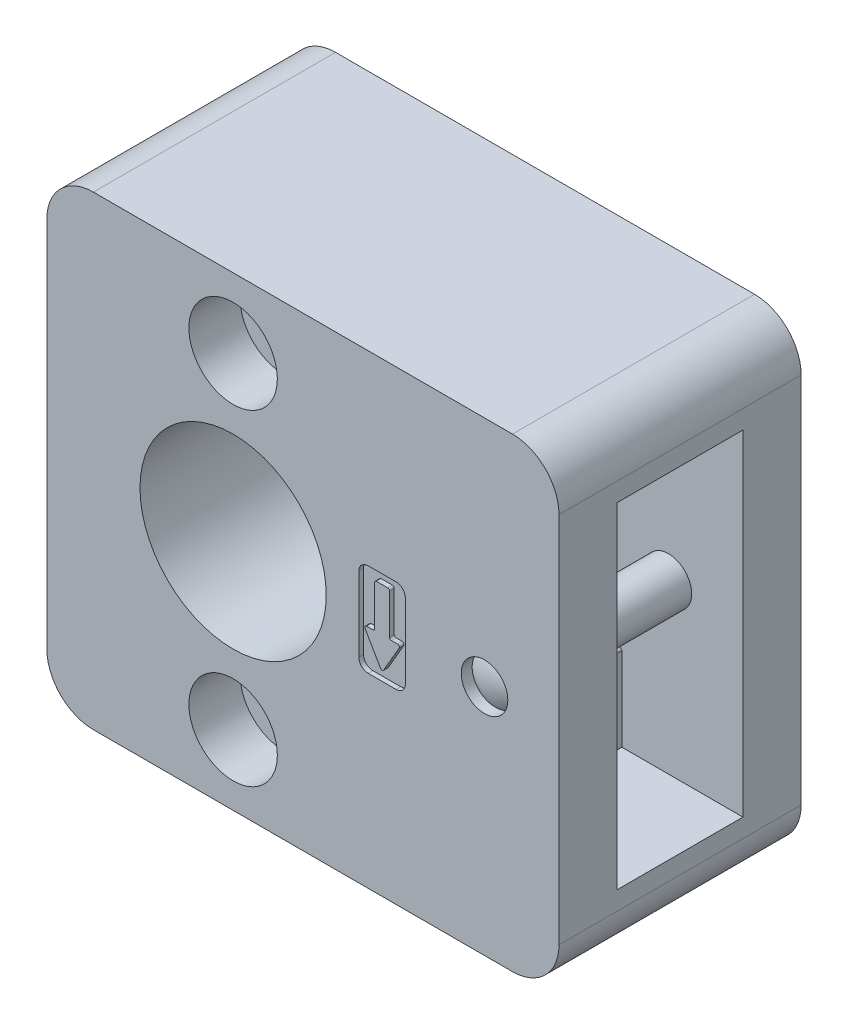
ISO-10303-21;
HEADER;
FILE_DESCRIPTION(('STEP AP214'),'2;1');
FILE_NAME('part.step','',(''),(''),'','','');
FILE_SCHEMA(('AUTOMOTIVE_DESIGN { 1 0 10303 214 1 1 1 1 }'));
ENDSEC;
DATA;
#1=APPLICATION_CONTEXT('core data for automotive mechanical design processes');
#2=APPLICATION_PROTOCOL_DEFINITION('international standard','automotive_design',2000,#1);
#3=PRODUCT_CONTEXT('',#1,'mechanical');
#4=PRODUCT('Part','Part','',(#3));
#5=PRODUCT_RELATED_PRODUCT_CATEGORY('part','',(#4));
#6=PRODUCT_DEFINITION_FORMATION('','',#4);
#7=PRODUCT_DEFINITION_CONTEXT('part definition',#1,'design');
#8=PRODUCT_DEFINITION('design','',#6,#7);
#9=PRODUCT_DEFINITION_SHAPE('','',#8);
#10=(LENGTH_UNIT() NAMED_UNIT(*) SI_UNIT(.MILLI.,.METRE.));
#11=(NAMED_UNIT(*) PLANE_ANGLE_UNIT() SI_UNIT($,.RADIAN.));
#12=(NAMED_UNIT(*) SI_UNIT($,.STERADIAN.) SOLID_ANGLE_UNIT());
#13=UNCERTAINTY_MEASURE_WITH_UNIT(LENGTH_MEASURE(1.E-05),#10,'distance_accuracy_value','');
#14=(GEOMETRIC_REPRESENTATION_CONTEXT(3) GLOBAL_UNCERTAINTY_ASSIGNED_CONTEXT((#13)) GLOBAL_UNIT_ASSIGNED_CONTEXT((#10,
#11,#12)) REPRESENTATION_CONTEXT('',''));
#15=CARTESIAN_POINT('',(0.,0.,0.));
#16=DIRECTION('',(0.,0.,1.));
#17=DIRECTION('',(1.,0.,0.));
#18=AXIS2_PLACEMENT_3D('',#15,#16,#17);
#19=CARTESIAN_POINT('',(27.,0.,20.5));
#20=DIRECTION('',(0.,0.,1.));
#21=DIRECTION('',(0.649435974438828,-0.76041627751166,0.));
#22=AXIS2_PLACEMENT_3D('',#19,#20,#21);
#23=SPHERICAL_SURFACE('',#22,5.);
#24=CARTESIAN_POINT('',(27.,0.,24.8301270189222));
#25=DIRECTION('',(0.,0.,-1.));
#26=DIRECTION('',(-0.649435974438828,0.76041627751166,0.));
#27=AXIS2_PLACEMENT_3D('',#24,#25,#26);
#28=CIRCLE('',#27,2.5);
#29=CARTESIAN_POINT('',(25.3764100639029,1.90104069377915,24.8301270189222));
#30=VERTEX_POINT('',#29);
#31=EDGE_CURVE('E931',#30,#30,#28,.F.);
#32=ORIENTED_EDGE('',*,*,#31,.T.);
#33=EDGE_LOOP('',(#32));
#34=FACE_BOUND('',#33,.T.);
#35=ADVANCED_FACE('F14',(#34),#23,.T.);
#36=CARTESIAN_POINT('',(27.,0.,0.5));
#37=DIRECTION('',(0.,0.,1.));
#38=DIRECTION('',(0.649435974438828,-0.76041627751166,0.));
#39=AXIS2_PLACEMENT_3D('',#36,#37,#38);
#40=CYLINDRICAL_SURFACE('',#39,2.5);
#41=CARTESIAN_POINT('',(27.,0.,19.75));
#42=DIRECTION('',(0.,0.,-1.));
#43=DIRECTION('',(-1.,0.,0.));
#44=AXIS2_PLACEMENT_3D('',#41,#42,#43);
#45=CIRCLE('',#44,2.5);
#46=CARTESIAN_POINT('',(24.5,0.,19.75));
#47=VERTEX_POINT('',#46);
#48=EDGE_CURVE('E22',#47,#47,#45,.T.);
#49=ORIENTED_EDGE('',*,*,#48,.T.);
#50=EDGE_LOOP('',(#49));
#51=FACE_BOUND('',#50,.T.);
#52=CARTESIAN_POINT('',(27.,0.,6.25));
#53=DIRECTION('',(0.,0.,-1.));
#54=DIRECTION('',(-1.,0.,0.));
#55=AXIS2_PLACEMENT_3D('',#52,#53,#54);
#56=CIRCLE('',#55,2.5);
#57=CARTESIAN_POINT('',(24.5,0.,6.25));
#58=VERTEX_POINT('',#57);
#59=EDGE_CURVE('E9',#58,#58,#56,.T.);
#60=ORIENTED_EDGE('',*,*,#59,.F.);
#61=EDGE_LOOP('',(#60));
#62=FACE_BOUND('',#61,.T.);
#63=ADVANCED_FACE('F16',(#51,#62),#40,.T.);
#64=CARTESIAN_POINT('',(27.,0.,0.5));
#65=DIRECTION('',(0.,0.,-1.));
#66=DIRECTION('',(-0.649435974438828,0.76041627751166,0.));
#67=AXIS2_PLACEMENT_3D('',#64,#65,#66);
#68=PLANE('',#67);
#69=CARTESIAN_POINT('',(27.,0.,0.5));
#70=DIRECTION('',(0.,0.,-1.));
#71=DIRECTION('',(-0.649435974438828,0.76041627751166,0.));
#72=AXIS2_PLACEMENT_3D('',#69,#70,#71);
#73=CIRCLE('',#72,2.2856406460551);
#74=CARTESIAN_POINT('',(25.5156227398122,1.73803835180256,0.5));
#75=VERTEX_POINT('',#74);
#76=EDGE_CURVE('E932',#75,#75,#73,.T.);
#77=ORIENTED_EDGE('',*,*,#76,.T.);
#78=EDGE_LOOP('',(#77));
#79=FACE_BOUND('',#78,.T.);
#80=ADVANCED_FACE('F973',(#79),#68,.T.);
#81=CARTESIAN_POINT('',(27.,0.,0.5));
#82=DIRECTION('',(0.,0.,1.));
#83=DIRECTION('',(0.649435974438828,-0.76041627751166,0.));
#84=AXIS2_PLACEMENT_3D('',#81,#82,#83);
#85=CONICAL_SURFACE('',#84,2.2856406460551,0.261799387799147);
#86=CARTESIAN_POINT('',(27.,0.,1.3));
#87=DIRECTION('',(0.,0.,-1.));
#88=DIRECTION('',(-0.649435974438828,0.76041627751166,0.));
#89=AXIS2_PLACEMENT_3D('',#86,#87,#88);
#90=CIRCLE('',#89,2.5);
#91=CARTESIAN_POINT('',(25.3764100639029,1.90104069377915,1.3));
#92=VERTEX_POINT('',#91);
#93=EDGE_CURVE('E935',#92,#92,#90,.F.);
#94=ORIENTED_EDGE('',*,*,#93,.F.);
#95=EDGE_LOOP('',(#94));
#96=FACE_BOUND('',#95,.T.);
#97=ORIENTED_EDGE('',*,*,#76,.F.);
#98=EDGE_LOOP('',(#97));
#99=FACE_BOUND('',#98,.T.);
#100=ADVANCED_FACE('F975',(#96,#99),#85,.T.);
#101=CARTESIAN_POINT('',(-20.,25.,0.));
#102=DIRECTION('',(0.,0.,-1.));
#103=DIRECTION('',(-1.,0.,0.));
#104=AXIS2_PLACEMENT_3D('',#101,#102,#103);
#105=PLANE('',#104);
#106=CARTESIAN_POINT('',(16.,-3.76410161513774,0.));
#107=DIRECTION('',(0.,0.,1.));
#108=DIRECTION('',(-1.,0.,0.));
#109=AXIS2_PLACEMENT_3D('',#106,#107,#108);
#110=CIRCLE('',#109,0.2);
#111=CARTESIAN_POINT('',(15.8267949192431,-3.86410161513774,0.));
#112=VERTEX_POINT('',#111);
#113=CARTESIAN_POINT('',(16.1732050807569,-3.86410161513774,0.));
#114=VERTEX_POINT('',#113);
#115=EDGE_CURVE('E431',#112,#114,#110,.T.);
#116=ORIENTED_EDGE('',*,*,#115,.F.);
#117=DIRECTION('',(0.5,-0.866025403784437,0.));
#118=VECTOR('',#117,1.);
#119=CARTESIAN_POINT('',(14.1732050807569,-1.,0.));
#120=LINE('',#119,#118);
#121=CARTESIAN_POINT('',(14.1732050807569,-1.,0.));
#122=VERTEX_POINT('',#121);
#123=EDGE_CURVE('E429',#122,#112,#120,.T.);
#124=ORIENTED_EDGE('',*,*,#123,.F.);
#125=CARTESIAN_POINT('',(14.3464101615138,-0.9,0.));
#126=DIRECTION('',(0.,0.,1.));
#127=DIRECTION('',(-1.,0.,0.));
#128=AXIS2_PLACEMENT_3D('',#125,#126,#127);
#129=CIRCLE('',#128,0.2);
#130=CARTESIAN_POINT('',(14.3464101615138,-0.7,0.));
#131=VERTEX_POINT('',#130);
#132=EDGE_CURVE('E407',#131,#122,#129,.T.);
#133=ORIENTED_EDGE('',*,*,#132,.F.);
#134=DIRECTION('',(-1.,0.,0.));
#135=VECTOR('',#134,1.);
#136=CARTESIAN_POINT('',(15.,-0.7,0.));
#137=LINE('',#136,#135);
#138=CARTESIAN_POINT('',(15.,-0.7,0.));
#139=VERTEX_POINT('',#138);
#140=EDGE_CURVE('E417',#139,#131,#137,.T.);
#141=ORIENTED_EDGE('',*,*,#140,.F.);
#142=CARTESIAN_POINT('',(15.,-0.5,0.));
#143=DIRECTION('',(0.,0.,-1.));
#144=DIRECTION('',(-1.,0.,0.));
#145=AXIS2_PLACEMENT_3D('',#142,#143,#144);
#146=CIRCLE('',#145,0.2);
#147=CARTESIAN_POINT('',(15.2,-0.5,0.));
#148=VERTEX_POINT('',#147);
#149=EDGE_CURVE('E423',#148,#139,#146,.T.);
#150=ORIENTED_EDGE('',*,*,#149,.F.);
#151=DIRECTION('',(0.,-1.,0.));
#152=VECTOR('',#151,1.);
#153=CARTESIAN_POINT('',(15.2,3.8,0.));
#154=LINE('',#153,#152);
#155=CARTESIAN_POINT('',(15.2,3.8,0.));
#156=VERTEX_POINT('',#155);
#157=EDGE_CURVE('E436',#156,#148,#154,.T.);
#158=ORIENTED_EDGE('',*,*,#157,.F.);
#159=CARTESIAN_POINT('',(15.4,3.8,0.));
#160=DIRECTION('',(0.,0.,1.));
#161=DIRECTION('',(-1.,0.,0.));
#162=AXIS2_PLACEMENT_3D('',#159,#160,#161);
#163=CIRCLE('',#162,0.2);
#164=CARTESIAN_POINT('',(15.4,4.,0.));
#165=VERTEX_POINT('',#164);
#166=EDGE_CURVE('E439',#165,#156,#163,.T.);
#167=ORIENTED_EDGE('',*,*,#166,.F.);
#168=DIRECTION('',(-1.,0.,0.));
#169=VECTOR('',#168,1.);
#170=CARTESIAN_POINT('',(15.4,4.,0.));
#171=LINE('',#170,#169);
#172=CARTESIAN_POINT('',(16.6,4.,0.));
#173=VERTEX_POINT('',#172);
#174=EDGE_CURVE('E442',#173,#165,#171,.T.);
#175=ORIENTED_EDGE('',*,*,#174,.F.);
#176=CARTESIAN_POINT('',(16.6,3.8,0.));
#177=DIRECTION('',(0.,0.,1.));
#178=DIRECTION('',(1.,0.,0.));
#179=AXIS2_PLACEMENT_3D('',#176,#177,#178);
#180=CIRCLE('',#179,0.2);
#181=CARTESIAN_POINT('',(16.8,3.8,0.));
#182=VERTEX_POINT('',#181);
#183=EDGE_CURVE('E445',#182,#173,#180,.T.);
#184=ORIENTED_EDGE('',*,*,#183,.F.);
#185=DIRECTION('',(0.,1.,0.));
#186=VECTOR('',#185,1.);
#187=CARTESIAN_POINT('',(16.8,3.8,0.));
#188=LINE('',#187,#186);
#189=CARTESIAN_POINT('',(16.8,-0.5,0.));
#190=VERTEX_POINT('',#189);
#191=EDGE_CURVE('E448',#190,#182,#188,.T.);
#192=ORIENTED_EDGE('',*,*,#191,.F.);
#193=CARTESIAN_POINT('',(17.,-0.5,0.));
#194=DIRECTION('',(0.,0.,-1.));
#195=DIRECTION('',(1.,0.,0.));
#196=AXIS2_PLACEMENT_3D('',#193,#194,#195);
#197=CIRCLE('',#196,0.2);
#198=CARTESIAN_POINT('',(17.,-0.7,0.));
#199=VERTEX_POINT('',#198);
#200=EDGE_CURVE('E451',#199,#190,#197,.T.);
#201=ORIENTED_EDGE('',*,*,#200,.F.);
#202=DIRECTION('',(-1.,0.,0.));
#203=VECTOR('',#202,1.);
#204=CARTESIAN_POINT('',(17.,-0.7,0.));
#205=LINE('',#204,#203);
#206=CARTESIAN_POINT('',(17.6535898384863,-0.7,0.));
#207=VERTEX_POINT('',#206);
#208=EDGE_CURVE('E454',#207,#199,#205,.T.);
#209=ORIENTED_EDGE('',*,*,#208,.F.);
#210=CARTESIAN_POINT('',(17.6535898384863,-0.9,0.));
#211=DIRECTION('',(0.,0.,1.));
#212=DIRECTION('',(1.,0.,0.));
#213=AXIS2_PLACEMENT_3D('',#210,#211,#212);
#214=CIRCLE('',#213,0.2);
#215=CARTESIAN_POINT('',(17.8267949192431,-1.,0.));
#216=VERTEX_POINT('',#215);
#217=EDGE_CURVE('E457',#216,#207,#214,.T.);
#218=ORIENTED_EDGE('',*,*,#217,.F.);
#219=DIRECTION('',(0.5,0.866025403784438,0.));
#220=VECTOR('',#219,1.);
#221=CARTESIAN_POINT('',(17.8267949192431,-1.,0.));
#222=LINE('',#221,#220);
#223=EDGE_CURVE('E460',#114,#216,#222,.T.);
#224=ORIENTED_EDGE('',*,*,#223,.F.);
#225=EDGE_LOOP('',(#116,#124,#133,#141,#150,#158,#167,#175,#184,#192,#201,#209,#218,#224));
#226=FACE_BOUND('',#225,.T.);
#227=ADVANCED_FACE('F427',(#226),#105,.T.);
#228=CARTESIAN_POINT('',(-20.,25.,26.));
#229=DIRECTION('',(0.,0.,-1.));
#230=DIRECTION('',(-1.,0.,0.));
#231=AXIS2_PLACEMENT_3D('',#228,#229,#230);
#232=PLANE('',#231);
#233=CARTESIAN_POINT('',(16.,-3.76410161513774,26.));
#234=DIRECTION('',(0.,0.,1.));
#235=DIRECTION('',(-1.,0.,0.));
#236=AXIS2_PLACEMENT_3D('',#233,#234,#235);
#237=CIRCLE('',#236,0.2);
#238=CARTESIAN_POINT('',(15.8267949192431,-3.86410161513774,26.));
#239=VERTEX_POINT('',#238);
#240=CARTESIAN_POINT('',(16.1732050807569,-3.86410161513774,26.));
#241=VERTEX_POINT('',#240);
#242=EDGE_CURVE('E559',#239,#241,#237,.T.);
#243=ORIENTED_EDGE('',*,*,#242,.T.);
#244=DIRECTION('',(0.5,0.866025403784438,0.));
#245=VECTOR('',#244,1.);
#246=CARTESIAN_POINT('',(17.8267949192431,-1.,26.));
#247=LINE('',#246,#245);
#248=CARTESIAN_POINT('',(17.8267949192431,-1.,26.));
#249=VERTEX_POINT('',#248);
#250=EDGE_CURVE('E576',#241,#249,#247,.T.);
#251=ORIENTED_EDGE('',*,*,#250,.T.);
#252=CARTESIAN_POINT('',(17.6535898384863,-0.9,26.));
#253=DIRECTION('',(0.,0.,1.));
#254=DIRECTION('',(1.,0.,0.));
#255=AXIS2_PLACEMENT_3D('',#252,#253,#254);
#256=CIRCLE('',#255,0.2);
#257=CARTESIAN_POINT('',(17.6535898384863,-0.7,26.));
#258=VERTEX_POINT('',#257);
#259=EDGE_CURVE('E579',#249,#258,#256,.T.);
#260=ORIENTED_EDGE('',*,*,#259,.T.);
#261=DIRECTION('',(-1.,0.,0.));
#262=VECTOR('',#261,1.);
#263=CARTESIAN_POINT('',(17.,-0.7,26.));
#264=LINE('',#263,#262);
#265=CARTESIAN_POINT('',(17.,-0.7,26.));
#266=VERTEX_POINT('',#265);
#267=EDGE_CURVE('E582',#258,#266,#264,.T.);
#268=ORIENTED_EDGE('',*,*,#267,.T.);
#269=CARTESIAN_POINT('',(17.,-0.5,26.));
#270=DIRECTION('',(0.,0.,-1.));
#271=DIRECTION('',(1.,0.,0.));
#272=AXIS2_PLACEMENT_3D('',#269,#270,#271);
#273=CIRCLE('',#272,0.2);
#274=CARTESIAN_POINT('',(16.8,-0.5,26.));
#275=VERTEX_POINT('',#274);
#276=EDGE_CURVE('E585',#266,#275,#273,.T.);
#277=ORIENTED_EDGE('',*,*,#276,.T.);
#278=DIRECTION('',(0.,1.,0.));
#279=VECTOR('',#278,1.);
#280=CARTESIAN_POINT('',(16.8,3.8,26.));
#281=LINE('',#280,#279);
#282=CARTESIAN_POINT('',(16.8,3.8,26.));
#283=VERTEX_POINT('',#282);
#284=EDGE_CURVE('E588',#275,#283,#281,.T.);
#285=ORIENTED_EDGE('',*,*,#284,.T.);
#286=CARTESIAN_POINT('',(16.6,3.8,26.));
#287=DIRECTION('',(0.,0.,1.));
#288=DIRECTION('',(1.,0.,0.));
#289=AXIS2_PLACEMENT_3D('',#286,#287,#288);
#290=CIRCLE('',#289,0.2);
#291=CARTESIAN_POINT('',(16.6,4.,26.));
#292=VERTEX_POINT('',#291);
#293=EDGE_CURVE('E591',#283,#292,#290,.T.);
#294=ORIENTED_EDGE('',*,*,#293,.T.);
#295=DIRECTION('',(-1.,0.,0.));
#296=VECTOR('',#295,1.);
#297=CARTESIAN_POINT('',(15.4,4.,26.));
#298=LINE('',#297,#296);
#299=CARTESIAN_POINT('',(15.4,4.,26.));
#300=VERTEX_POINT('',#299);
#301=EDGE_CURVE('E594',#292,#300,#298,.T.);
#302=ORIENTED_EDGE('',*,*,#301,.T.);
#303=CARTESIAN_POINT('',(15.4,3.8,26.));
#304=DIRECTION('',(0.,0.,1.));
#305=DIRECTION('',(-1.,0.,0.));
#306=AXIS2_PLACEMENT_3D('',#303,#304,#305);
#307=CIRCLE('',#306,0.2);
#308=CARTESIAN_POINT('',(15.2,3.8,26.));
#309=VERTEX_POINT('',#308);
#310=EDGE_CURVE('E597',#300,#309,#307,.T.);
#311=ORIENTED_EDGE('',*,*,#310,.T.);
#312=DIRECTION('',(0.,-1.,0.));
#313=VECTOR('',#312,1.);
#314=CARTESIAN_POINT('',(15.2,3.8,26.));
#315=LINE('',#314,#313);
#316=CARTESIAN_POINT('',(15.2,-0.5,26.));
#317=VERTEX_POINT('',#316);
#318=EDGE_CURVE('E600',#309,#317,#315,.T.);
#319=ORIENTED_EDGE('',*,*,#318,.T.);
#320=CARTESIAN_POINT('',(15.,-0.5,26.));
#321=DIRECTION('',(0.,0.,-1.));
#322=DIRECTION('',(-1.,0.,0.));
#323=AXIS2_PLACEMENT_3D('',#320,#321,#322);
#324=CIRCLE('',#323,0.2);
#325=CARTESIAN_POINT('',(15.,-0.7,26.));
#326=VERTEX_POINT('',#325);
#327=EDGE_CURVE('E603',#317,#326,#324,.T.);
#328=ORIENTED_EDGE('',*,*,#327,.T.);
#329=DIRECTION('',(-1.,0.,0.));
#330=VECTOR('',#329,1.);
#331=CARTESIAN_POINT('',(15.,-0.7,26.));
#332=LINE('',#331,#330);
#333=CARTESIAN_POINT('',(14.3464101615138,-0.7,26.));
#334=VERTEX_POINT('',#333);
#335=EDGE_CURVE('E606',#326,#334,#332,.T.);
#336=ORIENTED_EDGE('',*,*,#335,.T.);
#337=CARTESIAN_POINT('',(14.3464101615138,-0.9,26.));
#338=DIRECTION('',(0.,0.,1.));
#339=DIRECTION('',(-1.,0.,0.));
#340=AXIS2_PLACEMENT_3D('',#337,#338,#339);
#341=CIRCLE('',#340,0.2);
#342=CARTESIAN_POINT('',(14.1732050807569,-1.,26.));
#343=VERTEX_POINT('',#342);
#344=EDGE_CURVE('E609',#334,#343,#341,.T.);
#345=ORIENTED_EDGE('',*,*,#344,.T.);
#346=DIRECTION('',(0.5,-0.866025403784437,0.));
#347=VECTOR('',#346,1.);
#348=CARTESIAN_POINT('',(14.1732050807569,-1.,26.));
#349=LINE('',#348,#347);
#350=EDGE_CURVE('E612',#343,#239,#349,.T.);
#351=ORIENTED_EDGE('',*,*,#350,.T.);
#352=EDGE_LOOP('',(#243,#251,#260,#268,#277,#285,#294,#302,#311,#319,#328,#336,#345,#351));
#353=FACE_BOUND('',#352,.T.);
#354=ADVANCED_FACE('F1001',(#353),#232,.F.);
#355=CARTESIAN_POINT('',(14.1732050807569,-1.,0.5));
#356=DIRECTION('',(0.866025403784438,0.5,0.));
#357=DIRECTION('',(-0.5,0.866025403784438,0.));
#358=AXIS2_PLACEMENT_3D('',#355,#356,#357);
#359=PLANE('',#358);
#360=ORIENTED_EDGE('',*,*,#123,.T.);
#361=DIRECTION('',(0.,0.,-1.));
#362=VECTOR('',#361,1.);
#363=CARTESIAN_POINT('',(15.8267949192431,-3.86410161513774,0.5));
#364=LINE('',#363,#362);
#365=CARTESIAN_POINT('',(15.8267949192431,-3.86410161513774,0.5));
#366=VERTEX_POINT('',#365);
#367=EDGE_CURVE('E490',#366,#112,#364,.T.);
#368=ORIENTED_EDGE('',*,*,#367,.F.);
#369=DIRECTION('',(0.5,-0.866025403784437,0.));
#370=VECTOR('',#369,1.);
#371=CARTESIAN_POINT('',(14.1732050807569,-1.,0.5));
#372=LINE('',#371,#370);
#373=CARTESIAN_POINT('',(14.1732050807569,-1.,0.5));
#374=VERTEX_POINT('',#373);
#375=EDGE_CURVE('E465',#374,#366,#372,.T.);
#376=ORIENTED_EDGE('',*,*,#375,.F.);
#377=DIRECTION('',(0.,0.,-1.));
#378=VECTOR('',#377,1.);
#379=CARTESIAN_POINT('',(14.1732050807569,-1.,0.5));
#380=LINE('',#379,#378);
#381=EDGE_CURVE('E414',#374,#122,#380,.T.);
#382=ORIENTED_EDGE('',*,*,#381,.T.);
#383=EDGE_LOOP('',(#360,#368,#376,#382));
#384=FACE_BOUND('',#383,.T.);
#385=ADVANCED_FACE('F1003',(#384),#359,.F.);
#386=CARTESIAN_POINT('',(14.3464101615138,-0.9,0.5));
#387=DIRECTION('',(0.,0.,-1.));
#388=DIRECTION('',(-1.,0.,0.));
#389=AXIS2_PLACEMENT_3D('',#386,#387,#388);
#390=CYLINDRICAL_SURFACE('',#389,0.2);
#391=ORIENTED_EDGE('',*,*,#132,.T.);
#392=ORIENTED_EDGE('',*,*,#381,.F.);
#393=CARTESIAN_POINT('',(14.3464101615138,-0.9,0.5));
#394=DIRECTION('',(0.,0.,1.));
#395=DIRECTION('',(-1.,0.,0.));
#396=AXIS2_PLACEMENT_3D('',#393,#394,#395);
#397=CIRCLE('',#396,0.2);
#398=CARTESIAN_POINT('',(14.3464101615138,-0.7,0.5));
#399=VERTEX_POINT('',#398);
#400=EDGE_CURVE('E410',#399,#374,#397,.T.);
#401=ORIENTED_EDGE('',*,*,#400,.F.);
#402=DIRECTION('',(0.,0.,-1.));
#403=VECTOR('',#402,1.);
#404=CARTESIAN_POINT('',(14.3464101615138,-0.7,0.5));
#405=LINE('',#404,#403);
#406=EDGE_CURVE('E403',#399,#131,#405,.T.);
#407=ORIENTED_EDGE('',*,*,#406,.T.);
#408=EDGE_LOOP('',(#391,#392,#401,#407));
#409=FACE_BOUND('',#408,.T.);
#410=ADVANCED_FACE('F405',(#409),#390,.T.);
#411=CARTESIAN_POINT('',(15.,-0.7,0.5));
#412=DIRECTION('',(0.,-1.,0.));
#413=DIRECTION('',(1.,0.,0.));
#414=AXIS2_PLACEMENT_3D('',#411,#412,#413);
#415=PLANE('',#414);
#416=ORIENTED_EDGE('',*,*,#140,.T.);
#417=ORIENTED_EDGE('',*,*,#406,.F.);
#418=DIRECTION('',(-1.,0.,0.));
#419=VECTOR('',#418,1.);
#420=CARTESIAN_POINT('',(15.,-0.7,0.5));
#421=LINE('',#420,#419);
#422=CARTESIAN_POINT('',(15.,-0.7,0.5));
#423=VERTEX_POINT('',#422);
#424=EDGE_CURVE('E468',#423,#399,#421,.T.);
#425=ORIENTED_EDGE('',*,*,#424,.F.);
#426=DIRECTION('',(0.,0.,-1.));
#427=VECTOR('',#426,1.);
#428=CARTESIAN_POINT('',(15.,-0.7,0.5));
#429=LINE('',#428,#427);
#430=EDGE_CURVE('E413',#423,#139,#429,.T.);
#431=ORIENTED_EDGE('',*,*,#430,.T.);
#432=EDGE_LOOP('',(#416,#417,#425,#431));
#433=FACE_BOUND('',#432,.T.);
#434=ADVANCED_FACE('F418',(#433),#415,.F.);
#435=CARTESIAN_POINT('',(15.,-0.5,0.5));
#436=DIRECTION('',(0.,0.,-1.));
#437=DIRECTION('',(-1.,0.,0.));
#438=AXIS2_PLACEMENT_3D('',#435,#436,#437);
#439=CYLINDRICAL_SURFACE('',#438,0.2);
#440=ORIENTED_EDGE('',*,*,#149,.T.);
#441=ORIENTED_EDGE('',*,*,#430,.F.);
#442=CARTESIAN_POINT('',(15.,-0.5,0.5));
#443=DIRECTION('',(0.,0.,-1.));
#444=DIRECTION('',(-1.,0.,0.));
#445=AXIS2_PLACEMENT_3D('',#442,#443,#444);
#446=CIRCLE('',#445,0.2);
#447=CARTESIAN_POINT('',(15.2,-0.5,0.5));
#448=VERTEX_POINT('',#447);
#449=EDGE_CURVE('E470',#448,#423,#446,.T.);
#450=ORIENTED_EDGE('',*,*,#449,.F.);
#451=DIRECTION('',(0.,0.,-1.));
#452=VECTOR('',#451,1.);
#453=CARTESIAN_POINT('',(15.2,-0.5,0.5));
#454=LINE('',#453,#452);
#455=EDGE_CURVE('E510',#448,#148,#454,.T.);
#456=ORIENTED_EDGE('',*,*,#455,.T.);
#457=EDGE_LOOP('',(#440,#441,#450,#456));
#458=FACE_BOUND('',#457,.T.);
#459=ADVANCED_FACE('F1800',(#458),#439,.F.);
#460=CARTESIAN_POINT('',(15.2,3.8,0.5));
#461=DIRECTION('',(1.,0.,0.));
#462=DIRECTION('',(0.,1.,0.));
#463=AXIS2_PLACEMENT_3D('',#460,#461,#462);
#464=PLANE('',#463);
#465=ORIENTED_EDGE('',*,*,#157,.T.);
#466=ORIENTED_EDGE('',*,*,#455,.F.);
#467=DIRECTION('',(0.,-1.,0.));
#468=VECTOR('',#467,1.);
#469=CARTESIAN_POINT('',(15.2,3.8,0.5));
#470=LINE('',#469,#468);
#471=CARTESIAN_POINT('',(15.2,3.8,0.5));
#472=VERTEX_POINT('',#471);
#473=EDGE_CURVE('E472',#472,#448,#470,.T.);
#474=ORIENTED_EDGE('',*,*,#473,.F.);
#475=DIRECTION('',(0.,0.,-1.));
#476=VECTOR('',#475,1.);
#477=CARTESIAN_POINT('',(15.2,3.8,0.5));
#478=LINE('',#477,#476);
#479=EDGE_CURVE('E508',#472,#156,#478,.T.);
#480=ORIENTED_EDGE('',*,*,#479,.T.);
#481=EDGE_LOOP('',(#465,#466,#474,#480));
#482=FACE_BOUND('',#481,.T.);
#483=ADVANCED_FACE('F1790',(#482),#464,.F.);
#484=CARTESIAN_POINT('',(15.4,3.8,0.5));
#485=DIRECTION('',(0.,0.,-1.));
#486=DIRECTION('',(-1.,0.,0.));
#487=AXIS2_PLACEMENT_3D('',#484,#485,#486);
#488=CYLINDRICAL_SURFACE('',#487,0.2);
#489=ORIENTED_EDGE('',*,*,#166,.T.);
#490=ORIENTED_EDGE('',*,*,#479,.F.);
#491=CARTESIAN_POINT('',(15.4,3.8,0.5));
#492=DIRECTION('',(0.,0.,1.));
#493=DIRECTION('',(-1.,0.,0.));
#494=AXIS2_PLACEMENT_3D('',#491,#492,#493);
#495=CIRCLE('',#494,0.2);
#496=CARTESIAN_POINT('',(15.4,4.,0.5));
#497=VERTEX_POINT('',#496);
#498=EDGE_CURVE('E474',#497,#472,#495,.T.);
#499=ORIENTED_EDGE('',*,*,#498,.F.);
#500=DIRECTION('',(0.,0.,-1.));
#501=VECTOR('',#500,1.);
#502=CARTESIAN_POINT('',(15.4,4.,0.5));
#503=LINE('',#502,#501);
#504=EDGE_CURVE('E506',#497,#165,#503,.T.);
#505=ORIENTED_EDGE('',*,*,#504,.T.);
#506=EDGE_LOOP('',(#489,#490,#499,#505));
#507=FACE_BOUND('',#506,.T.);
#508=ADVANCED_FACE('F1780',(#507),#488,.T.);
#509=CARTESIAN_POINT('',(15.4,4.,0.5));
#510=DIRECTION('',(0.,-1.,0.));
#511=DIRECTION('',(0.,0.,-1.));
#512=AXIS2_PLACEMENT_3D('',#509,#510,#511);
#513=PLANE('',#512);
#514=ORIENTED_EDGE('',*,*,#174,.T.);
#515=ORIENTED_EDGE('',*,*,#504,.F.);
#516=DIRECTION('',(-1.,0.,0.));
#517=VECTOR('',#516,1.);
#518=CARTESIAN_POINT('',(15.4,4.,0.5));
#519=LINE('',#518,#517);
#520=CARTESIAN_POINT('',(16.6,4.,0.5));
#521=VERTEX_POINT('',#520);
#522=EDGE_CURVE('E476',#521,#497,#519,.T.);
#523=ORIENTED_EDGE('',*,*,#522,.F.);
#524=DIRECTION('',(0.,0.,-1.));
#525=VECTOR('',#524,1.);
#526=CARTESIAN_POINT('',(16.6,4.,0.5));
#527=LINE('',#526,#525);
#528=EDGE_CURVE('E504',#521,#173,#527,.T.);
#529=ORIENTED_EDGE('',*,*,#528,.T.);
#530=EDGE_LOOP('',(#514,#515,#523,#529));
#531=FACE_BOUND('',#530,.T.);
#532=ADVANCED_FACE('F1770',(#531),#513,.F.);
#533=CARTESIAN_POINT('',(16.6,3.8,0.5));
#534=DIRECTION('',(0.,0.,-1.));
#535=DIRECTION('',(-1.,0.,0.));
#536=AXIS2_PLACEMENT_3D('',#533,#534,#535);
#537=CYLINDRICAL_SURFACE('',#536,0.2);
#538=ORIENTED_EDGE('',*,*,#183,.T.);
#539=ORIENTED_EDGE('',*,*,#528,.F.);
#540=CARTESIAN_POINT('',(16.6,3.8,0.5));
#541=DIRECTION('',(0.,0.,1.));
#542=DIRECTION('',(1.,0.,0.));
#543=AXIS2_PLACEMENT_3D('',#540,#541,#542);
#544=CIRCLE('',#543,0.2);
#545=CARTESIAN_POINT('',(16.8,3.8,0.5));
#546=VERTEX_POINT('',#545);
#547=EDGE_CURVE('E478',#546,#521,#544,.T.);
#548=ORIENTED_EDGE('',*,*,#547,.F.);
#549=DIRECTION('',(0.,0.,-1.));
#550=VECTOR('',#549,1.);
#551=CARTESIAN_POINT('',(16.8,3.8,0.5));
#552=LINE('',#551,#550);
#553=EDGE_CURVE('E502',#546,#182,#552,.T.);
#554=ORIENTED_EDGE('',*,*,#553,.T.);
#555=EDGE_LOOP('',(#538,#539,#548,#554));
#556=FACE_BOUND('',#555,.T.);
#557=ADVANCED_FACE('F1760',(#556),#537,.T.);
#558=CARTESIAN_POINT('',(16.8,3.8,0.5));
#559=DIRECTION('',(-1.,0.,0.));
#560=DIRECTION('',(0.,0.,1.));
#561=AXIS2_PLACEMENT_3D('',#558,#559,#560);
#562=PLANE('',#561);
#563=ORIENTED_EDGE('',*,*,#191,.T.);
#564=ORIENTED_EDGE('',*,*,#553,.F.);
#565=DIRECTION('',(0.,1.,0.));
#566=VECTOR('',#565,1.);
#567=CARTESIAN_POINT('',(16.8,3.8,0.5));
#568=LINE('',#567,#566);
#569=CARTESIAN_POINT('',(16.8,-0.5,0.5));
#570=VERTEX_POINT('',#569);
#571=EDGE_CURVE('E480',#570,#546,#568,.T.);
#572=ORIENTED_EDGE('',*,*,#571,.F.);
#573=DIRECTION('',(0.,0.,-1.));
#574=VECTOR('',#573,1.);
#575=CARTESIAN_POINT('',(16.8,-0.5,0.5));
#576=LINE('',#575,#574);
#577=EDGE_CURVE('E500',#570,#190,#576,.T.);
#578=ORIENTED_EDGE('',*,*,#577,.T.);
#579=EDGE_LOOP('',(#563,#564,#572,#578));
#580=FACE_BOUND('',#579,.T.);
#581=ADVANCED_FACE('F1750',(#580),#562,.F.);
#582=CARTESIAN_POINT('',(17.,-0.5,0.5));
#583=DIRECTION('',(0.,0.,-1.));
#584=DIRECTION('',(-1.,0.,0.));
#585=AXIS2_PLACEMENT_3D('',#582,#583,#584);
#586=CYLINDRICAL_SURFACE('',#585,0.2);
#587=ORIENTED_EDGE('',*,*,#200,.T.);
#588=ORIENTED_EDGE('',*,*,#577,.F.);
#589=CARTESIAN_POINT('',(17.,-0.5,0.5));
#590=DIRECTION('',(0.,0.,-1.));
#591=DIRECTION('',(1.,0.,0.));
#592=AXIS2_PLACEMENT_3D('',#589,#590,#591);
#593=CIRCLE('',#592,0.2);
#594=CARTESIAN_POINT('',(17.,-0.7,0.5));
#595=VERTEX_POINT('',#594);
#596=EDGE_CURVE('E482',#595,#570,#593,.T.);
#597=ORIENTED_EDGE('',*,*,#596,.F.);
#598=DIRECTION('',(0.,0.,-1.));
#599=VECTOR('',#598,1.);
#600=CARTESIAN_POINT('',(17.,-0.7,0.5));
#601=LINE('',#600,#599);
#602=EDGE_CURVE('E498',#595,#199,#601,.T.);
#603=ORIENTED_EDGE('',*,*,#602,.T.);
#604=EDGE_LOOP('',(#587,#588,#597,#603));
#605=FACE_BOUND('',#604,.T.);
#606=ADVANCED_FACE('F1740',(#605),#586,.F.);
#607=CARTESIAN_POINT('',(17.,-0.7,0.5));
#608=DIRECTION('',(0.,-1.,0.));
#609=DIRECTION('',(0.,0.,-1.));
#610=AXIS2_PLACEMENT_3D('',#607,#608,#609);
#611=PLANE('',#610);
#612=ORIENTED_EDGE('',*,*,#208,.T.);
#613=ORIENTED_EDGE('',*,*,#602,.F.);
#614=DIRECTION('',(-1.,0.,0.));
#615=VECTOR('',#614,1.);
#616=CARTESIAN_POINT('',(17.,-0.7,0.5));
#617=LINE('',#616,#615);
#618=CARTESIAN_POINT('',(17.6535898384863,-0.7,0.5));
#619=VERTEX_POINT('',#618);
#620=EDGE_CURVE('E484',#619,#595,#617,.T.);
#621=ORIENTED_EDGE('',*,*,#620,.F.);
#622=DIRECTION('',(0.,0.,-1.));
#623=VECTOR('',#622,1.);
#624=CARTESIAN_POINT('',(17.6535898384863,-0.7,0.5));
#625=LINE('',#624,#623);
#626=EDGE_CURVE('E496',#619,#207,#625,.T.);
#627=ORIENTED_EDGE('',*,*,#626,.T.);
#628=EDGE_LOOP('',(#612,#613,#621,#627));
#629=FACE_BOUND('',#628,.T.);
#630=ADVANCED_FACE('F1730',(#629),#611,.F.);
#631=CARTESIAN_POINT('',(17.6535898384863,-0.9,0.5));
#632=DIRECTION('',(0.,0.,-1.));
#633=DIRECTION('',(-1.,0.,0.));
#634=AXIS2_PLACEMENT_3D('',#631,#632,#633);
#635=CYLINDRICAL_SURFACE('',#634,0.2);
#636=ORIENTED_EDGE('',*,*,#217,.T.);
#637=ORIENTED_EDGE('',*,*,#626,.F.);
#638=CARTESIAN_POINT('',(17.6535898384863,-0.9,0.5));
#639=DIRECTION('',(0.,0.,1.));
#640=DIRECTION('',(1.,0.,0.));
#641=AXIS2_PLACEMENT_3D('',#638,#639,#640);
#642=CIRCLE('',#641,0.2);
#643=CARTESIAN_POINT('',(17.8267949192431,-1.,0.5));
#644=VERTEX_POINT('',#643);
#645=EDGE_CURVE('E486',#644,#619,#642,.T.);
#646=ORIENTED_EDGE('',*,*,#645,.F.);
#647=DIRECTION('',(0.,0.,-1.));
#648=VECTOR('',#647,1.);
#649=CARTESIAN_POINT('',(17.8267949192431,-1.,0.5));
#650=LINE('',#649,#648);
#651=EDGE_CURVE('E494',#644,#216,#650,.T.);
#652=ORIENTED_EDGE('',*,*,#651,.T.);
#653=EDGE_LOOP('',(#636,#637,#646,#652));
#654=FACE_BOUND('',#653,.T.);
#655=ADVANCED_FACE('F1203',(#654),#635,.T.);
#656=CARTESIAN_POINT('',(17.8267949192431,-1.,0.5));
#657=DIRECTION('',(-0.866025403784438,0.5,0.));
#658=DIRECTION('',(-0.5,-0.866025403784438,0.));
#659=AXIS2_PLACEMENT_3D('',#656,#657,#658);
#660=PLANE('',#659);
#661=ORIENTED_EDGE('',*,*,#223,.T.);
#662=ORIENTED_EDGE('',*,*,#651,.F.);
#663=DIRECTION('',(0.5,0.866025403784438,0.));
#664=VECTOR('',#663,1.);
#665=CARTESIAN_POINT('',(17.8267949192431,-1.,0.5));
#666=LINE('',#665,#664);
#667=CARTESIAN_POINT('',(16.1732050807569,-3.86410161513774,0.5));
#668=VERTEX_POINT('',#667);
#669=EDGE_CURVE('E488',#668,#644,#666,.T.);
#670=ORIENTED_EDGE('',*,*,#669,.F.);
#671=DIRECTION('',(0.,0.,-1.));
#672=VECTOR('',#671,1.);
#673=CARTESIAN_POINT('',(16.1732050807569,-3.86410161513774,0.5));
#674=LINE('',#673,#672);
#675=EDGE_CURVE('E491',#668,#114,#674,.T.);
#676=ORIENTED_EDGE('',*,*,#675,.T.);
#677=EDGE_LOOP('',(#661,#662,#670,#676));
#678=FACE_BOUND('',#677,.T.);
#679=ADVANCED_FACE('F1196',(#678),#660,.F.);
#680=CARTESIAN_POINT('',(16.,-3.76410161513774,0.5));
#681=DIRECTION('',(0.,0.,-1.));
#682=DIRECTION('',(-1.,0.,0.));
#683=AXIS2_PLACEMENT_3D('',#680,#681,#682);
#684=CYLINDRICAL_SURFACE('',#683,0.2);
#685=ORIENTED_EDGE('',*,*,#115,.T.);
#686=ORIENTED_EDGE('',*,*,#675,.F.);
#687=CARTESIAN_POINT('',(16.,-3.76410161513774,0.5));
#688=DIRECTION('',(0.,0.,1.));
#689=DIRECTION('',(-1.,0.,0.));
#690=AXIS2_PLACEMENT_3D('',#687,#688,#689);
#691=CIRCLE('',#690,0.2);
#692=EDGE_CURVE('E463',#366,#668,#691,.T.);
#693=ORIENTED_EDGE('',*,*,#692,.F.);
#694=ORIENTED_EDGE('',*,*,#367,.T.);
#695=EDGE_LOOP('',(#685,#686,#693,#694));
#696=FACE_BOUND('',#695,.T.);
#697=ADVANCED_FACE('F1034',(#696),#684,.T.);
#698=CARTESIAN_POINT('',(0.,-17.5,26.));
#699=DIRECTION('',(0.,0.,1.));
#700=DIRECTION('',(1.,0.,0.));
#701=AXIS2_PLACEMENT_3D('',#698,#699,#700);
#702=CYLINDRICAL_SURFACE('',#701,2.75);
#703=CARTESIAN_POINT('',(0.,-17.5,20.5));
#704=DIRECTION('',(0.,0.,1.));
#705=DIRECTION('',(1.,0.,0.));
#706=AXIS2_PLACEMENT_3D('',#703,#704,#705);
#707=CIRCLE('',#706,2.75);
#708=CARTESIAN_POINT('',(2.75,-17.5,20.5));
#709=VERTEX_POINT('',#708);
#710=EDGE_CURVE('E795',#709,#709,#707,.T.);
#711=ORIENTED_EDGE('',*,*,#710,.T.);
#712=EDGE_LOOP('',(#711));
#713=FACE_BOUND('',#712,.T.);
#714=CARTESIAN_POINT('',(0.,-17.5,5.5));
#715=DIRECTION('',(0.,0.,-1.));
#716=DIRECTION('',(-1.,0.,0.));
#717=AXIS2_PLACEMENT_3D('',#714,#715,#716);
#718=CIRCLE('',#717,2.75);
#719=CARTESIAN_POINT('',(-2.75,-17.5,5.5));
#720=VERTEX_POINT('',#719);
#721=EDGE_CURVE('E785',#720,#720,#718,.F.);
#722=ORIENTED_EDGE('',*,*,#721,.F.);
#723=EDGE_LOOP('',(#722));
#724=FACE_BOUND('',#723,.T.);
#725=ADVANCED_FACE('F1021',(#713,#724),#702,.F.);
#726=CARTESIAN_POINT('',(0.,17.5,26.));
#727=DIRECTION('',(0.,0.,1.));
#728=DIRECTION('',(1.,0.,0.));
#729=AXIS2_PLACEMENT_3D('',#726,#727,#728);
#730=CYLINDRICAL_SURFACE('',#729,2.75);
#731=CARTESIAN_POINT('',(0.,17.5,20.5));
#732=DIRECTION('',(0.,0.,1.));
#733=DIRECTION('',(1.,0.,0.));
#734=AXIS2_PLACEMENT_3D('',#731,#732,#733);
#735=CIRCLE('',#734,2.75);
#736=CARTESIAN_POINT('',(2.75,17.5,20.5));
#737=VERTEX_POINT('',#736);
#738=EDGE_CURVE('E786',#737,#737,#735,.T.);
#739=ORIENTED_EDGE('',*,*,#738,.T.);
#740=EDGE_LOOP('',(#739));
#741=FACE_BOUND('',#740,.T.);
#742=CARTESIAN_POINT('',(0.,17.5,5.5));
#743=DIRECTION('',(0.,0.,-1.));
#744=DIRECTION('',(-1.,0.,0.));
#745=AXIS2_PLACEMENT_3D('',#742,#743,#744);
#746=CIRCLE('',#745,2.75);
#747=CARTESIAN_POINT('',(-2.75,17.5,5.5));
#748=VERTEX_POINT('',#747);
#749=EDGE_CURVE('E778',#748,#748,#746,.F.);
#750=ORIENTED_EDGE('',*,*,#749,.F.);
#751=EDGE_LOOP('',(#750));
#752=FACE_BOUND('',#751,.T.);
#753=ADVANCED_FACE('F1006',(#741,#752),#730,.F.);
#754=CARTESIAN_POINT('',(16.,-3.76410161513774,25.5));
#755=DIRECTION('',(0.,0.,1.));
#756=DIRECTION('',(1.,0.,0.));
#757=AXIS2_PLACEMENT_3D('',#754,#755,#756);
#758=CYLINDRICAL_SURFACE('',#757,0.2);
#759=ORIENTED_EDGE('',*,*,#242,.F.);
#760=DIRECTION('',(0.,0.,1.));
#761=VECTOR('',#760,1.);
#762=CARTESIAN_POINT('',(15.8267949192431,-3.86410161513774,25.5));
#763=LINE('',#762,#761);
#764=CARTESIAN_POINT('',(15.8267949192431,-3.86410161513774,25.5));
#765=VERTEX_POINT('',#764);
#766=EDGE_CURVE('E658',#765,#239,#763,.T.);
#767=ORIENTED_EDGE('',*,*,#766,.F.);
#768=CARTESIAN_POINT('',(16.,-3.76410161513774,25.5));
#769=DIRECTION('',(0.,0.,1.));
#770=DIRECTION('',(-1.,0.,0.));
#771=AXIS2_PLACEMENT_3D('',#768,#769,#770);
#772=CIRCLE('',#771,0.2);
#773=CARTESIAN_POINT('',(16.1732050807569,-3.86410161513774,25.5));
#774=VERTEX_POINT('',#773);
#775=EDGE_CURVE('E615',#765,#774,#772,.T.);
#776=ORIENTED_EDGE('',*,*,#775,.T.);
#777=DIRECTION('',(0.,0.,1.));
#778=VECTOR('',#777,1.);
#779=CARTESIAN_POINT('',(16.1732050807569,-3.86410161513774,25.5));
#780=LINE('',#779,#778);
#781=EDGE_CURVE('E657',#774,#241,#780,.T.);
#782=ORIENTED_EDGE('',*,*,#781,.T.);
#783=EDGE_LOOP('',(#759,#767,#776,#782));
#784=FACE_BOUND('',#783,.T.);
#785=ADVANCED_FACE('F1020',(#784),#758,.T.);
#786=CARTESIAN_POINT('',(17.8267949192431,-1.,25.5));
#787=DIRECTION('',(0.866025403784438,-0.5,0.));
#788=DIRECTION('',(0.5,0.866025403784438,0.));
#789=AXIS2_PLACEMENT_3D('',#786,#787,#788);
#790=PLANE('',#789);
#791=ORIENTED_EDGE('',*,*,#250,.F.);
#792=ORIENTED_EDGE('',*,*,#781,.F.);
#793=DIRECTION('',(0.5,0.866025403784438,0.));
#794=VECTOR('',#793,1.);
#795=CARTESIAN_POINT('',(17.8267949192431,-1.,25.5));
#796=LINE('',#795,#794);
#797=CARTESIAN_POINT('',(17.8267949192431,-1.,25.5));
#798=VERTEX_POINT('',#797);
#799=EDGE_CURVE('E618',#774,#798,#796,.T.);
#800=ORIENTED_EDGE('',*,*,#799,.T.);
#801=DIRECTION('',(0.,0.,1.));
#802=VECTOR('',#801,1.);
#803=CARTESIAN_POINT('',(17.8267949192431,-1.,25.5));
#804=LINE('',#803,#802);
#805=EDGE_CURVE('E683',#798,#249,#804,.T.);
#806=ORIENTED_EDGE('',*,*,#805,.T.);
#807=EDGE_LOOP('',(#791,#792,#800,#806));
#808=FACE_BOUND('',#807,.T.);
#809=ADVANCED_FACE('F1029',(#808),#790,.T.);
#810=CARTESIAN_POINT('',(17.6535898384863,-0.9,25.5));
#811=DIRECTION('',(0.,0.,1.));
#812=DIRECTION('',(1.,0.,0.));
#813=AXIS2_PLACEMENT_3D('',#810,#811,#812);
#814=CYLINDRICAL_SURFACE('',#813,0.2);
#815=ORIENTED_EDGE('',*,*,#259,.F.);
#816=ORIENTED_EDGE('',*,*,#805,.F.);
#817=CARTESIAN_POINT('',(17.6535898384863,-0.9,25.5));
#818=DIRECTION('',(0.,0.,1.));
#819=DIRECTION('',(1.,0.,0.));
#820=AXIS2_PLACEMENT_3D('',#817,#818,#819);
#821=CIRCLE('',#820,0.2);
#822=CARTESIAN_POINT('',(17.6535898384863,-0.7,25.5));
#823=VERTEX_POINT('',#822);
#824=EDGE_CURVE('E621',#798,#823,#821,.T.);
#825=ORIENTED_EDGE('',*,*,#824,.T.);
#826=DIRECTION('',(0.,0.,1.));
#827=VECTOR('',#826,1.);
#828=CARTESIAN_POINT('',(17.6535898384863,-0.7,25.5));
#829=LINE('',#828,#827);
#830=EDGE_CURVE('E681',#823,#258,#829,.T.);
#831=ORIENTED_EDGE('',*,*,#830,.T.);
#832=EDGE_LOOP('',(#815,#816,#825,#831));
#833=FACE_BOUND('',#832,.T.);
#834=ADVANCED_FACE('F1609',(#833),#814,.T.);
#835=CARTESIAN_POINT('',(17.,-0.7,25.5));
#836=DIRECTION('',(0.,1.,0.));
#837=DIRECTION('',(0.,0.,1.));
#838=AXIS2_PLACEMENT_3D('',#835,#836,#837);
#839=PLANE('',#838);
#840=ORIENTED_EDGE('',*,*,#267,.F.);
#841=ORIENTED_EDGE('',*,*,#830,.F.);
#842=DIRECTION('',(-1.,0.,0.));
#843=VECTOR('',#842,1.);
#844=CARTESIAN_POINT('',(17.,-0.7,25.5));
#845=LINE('',#844,#843);
#846=CARTESIAN_POINT('',(17.,-0.7,25.5));
#847=VERTEX_POINT('',#846);
#848=EDGE_CURVE('E624',#823,#847,#845,.T.);
#849=ORIENTED_EDGE('',*,*,#848,.T.);
#850=DIRECTION('',(0.,0.,1.));
#851=VECTOR('',#850,1.);
#852=CARTESIAN_POINT('',(17.,-0.7,25.5));
#853=LINE('',#852,#851);
#854=EDGE_CURVE('E679',#847,#266,#853,.T.);
#855=ORIENTED_EDGE('',*,*,#854,.T.);
#856=EDGE_LOOP('',(#840,#841,#849,#855));
#857=FACE_BOUND('',#856,.T.);
#858=ADVANCED_FACE('F1620',(#857),#839,.T.);
#859=CARTESIAN_POINT('',(17.,-0.5,25.5));
#860=DIRECTION('',(0.,0.,1.));
#861=DIRECTION('',(1.,0.,0.));
#862=AXIS2_PLACEMENT_3D('',#859,#860,#861);
#863=CYLINDRICAL_SURFACE('',#862,0.2);
#864=ORIENTED_EDGE('',*,*,#276,.F.);
#865=ORIENTED_EDGE('',*,*,#854,.F.);
#866=CARTESIAN_POINT('',(17.,-0.5,25.5));
#867=DIRECTION('',(0.,0.,-1.));
#868=DIRECTION('',(1.,0.,0.));
#869=AXIS2_PLACEMENT_3D('',#866,#867,#868);
#870=CIRCLE('',#869,0.2);
#871=CARTESIAN_POINT('',(16.8,-0.5,25.5));
#872=VERTEX_POINT('',#871);
#873=EDGE_CURVE('E627',#847,#872,#870,.T.);
#874=ORIENTED_EDGE('',*,*,#873,.T.);
#875=DIRECTION('',(0.,0.,1.));
#876=VECTOR('',#875,1.);
#877=CARTESIAN_POINT('',(16.8,-0.5,25.5));
#878=LINE('',#877,#876);
#879=EDGE_CURVE('E677',#872,#275,#878,.T.);
#880=ORIENTED_EDGE('',*,*,#879,.T.);
#881=EDGE_LOOP('',(#864,#865,#874,#880));
#882=FACE_BOUND('',#881,.T.);
#883=ADVANCED_FACE('F1630',(#882),#863,.F.);
#884=CARTESIAN_POINT('',(16.8,3.8,25.5));
#885=DIRECTION('',(1.,0.,0.));
#886=DIRECTION('',(0.,0.,-1.));
#887=AXIS2_PLACEMENT_3D('',#884,#885,#886);
#888=PLANE('',#887);
#889=ORIENTED_EDGE('',*,*,#284,.F.);
#890=ORIENTED_EDGE('',*,*,#879,.F.);
#891=DIRECTION('',(0.,1.,0.));
#892=VECTOR('',#891,1.);
#893=CARTESIAN_POINT('',(16.8,3.8,25.5));
#894=LINE('',#893,#892);
#895=CARTESIAN_POINT('',(16.8,3.8,25.5));
#896=VERTEX_POINT('',#895);
#897=EDGE_CURVE('E630',#872,#896,#894,.T.);
#898=ORIENTED_EDGE('',*,*,#897,.T.);
#899=DIRECTION('',(0.,0.,1.));
#900=VECTOR('',#899,1.);
#901=CARTESIAN_POINT('',(16.8,3.8,25.5));
#902=LINE('',#901,#900);
#903=EDGE_CURVE('E675',#896,#283,#902,.T.);
#904=ORIENTED_EDGE('',*,*,#903,.T.);
#905=EDGE_LOOP('',(#889,#890,#898,#904));
#906=FACE_BOUND('',#905,.T.);
#907=ADVANCED_FACE('F1640',(#906),#888,.T.);
#908=CARTESIAN_POINT('',(16.6,3.8,25.5));
#909=DIRECTION('',(0.,0.,1.));
#910=DIRECTION('',(1.,0.,0.));
#911=AXIS2_PLACEMENT_3D('',#908,#909,#910);
#912=CYLINDRICAL_SURFACE('',#911,0.2);
#913=ORIENTED_EDGE('',*,*,#293,.F.);
#914=ORIENTED_EDGE('',*,*,#903,.F.);
#915=CARTESIAN_POINT('',(16.6,3.8,25.5));
#916=DIRECTION('',(0.,0.,1.));
#917=DIRECTION('',(1.,0.,0.));
#918=AXIS2_PLACEMENT_3D('',#915,#916,#917);
#919=CIRCLE('',#918,0.2);
#920=CARTESIAN_POINT('',(16.6,4.,25.5));
#921=VERTEX_POINT('',#920);
#922=EDGE_CURVE('E633',#896,#921,#919,.T.);
#923=ORIENTED_EDGE('',*,*,#922,.T.);
#924=DIRECTION('',(0.,0.,1.));
#925=VECTOR('',#924,1.);
#926=CARTESIAN_POINT('',(16.6,4.,25.5));
#927=LINE('',#926,#925);
#928=EDGE_CURVE('E673',#921,#292,#927,.T.);
#929=ORIENTED_EDGE('',*,*,#928,.T.);
#930=EDGE_LOOP('',(#913,#914,#923,#929));
#931=FACE_BOUND('',#930,.T.);
#932=ADVANCED_FACE('F1650',(#931),#912,.T.);
#933=CARTESIAN_POINT('',(15.4,4.,25.5));
#934=DIRECTION('',(0.,1.,0.));
#935=DIRECTION('',(0.,0.,1.));
#936=AXIS2_PLACEMENT_3D('',#933,#934,#935);
#937=PLANE('',#936);
#938=ORIENTED_EDGE('',*,*,#301,.F.);
#939=ORIENTED_EDGE('',*,*,#928,.F.);
#940=DIRECTION('',(-1.,0.,0.));
#941=VECTOR('',#940,1.);
#942=CARTESIAN_POINT('',(15.4,4.,25.5));
#943=LINE('',#942,#941);
#944=CARTESIAN_POINT('',(15.4,4.,25.5));
#945=VERTEX_POINT('',#944);
#946=EDGE_CURVE('E636',#921,#945,#943,.T.);
#947=ORIENTED_EDGE('',*,*,#946,.T.);
#948=DIRECTION('',(0.,0.,1.));
#949=VECTOR('',#948,1.);
#950=CARTESIAN_POINT('',(15.4,4.,25.5));
#951=LINE('',#950,#949);
#952=EDGE_CURVE('E671',#945,#300,#951,.T.);
#953=ORIENTED_EDGE('',*,*,#952,.T.);
#954=EDGE_LOOP('',(#938,#939,#947,#953));
#955=FACE_BOUND('',#954,.T.);
#956=ADVANCED_FACE('F1660',(#955),#937,.T.);
#957=CARTESIAN_POINT('',(15.4,3.8,25.5));
#958=DIRECTION('',(0.,0.,1.));
#959=DIRECTION('',(1.,0.,0.));
#960=AXIS2_PLACEMENT_3D('',#957,#958,#959);
#961=CYLINDRICAL_SURFACE('',#960,0.2);
#962=ORIENTED_EDGE('',*,*,#310,.F.);
#963=ORIENTED_EDGE('',*,*,#952,.F.);
#964=CARTESIAN_POINT('',(15.4,3.8,25.5));
#965=DIRECTION('',(0.,0.,1.));
#966=DIRECTION('',(-1.,0.,0.));
#967=AXIS2_PLACEMENT_3D('',#964,#965,#966);
#968=CIRCLE('',#967,0.2);
#969=CARTESIAN_POINT('',(15.2,3.8,25.5));
#970=VERTEX_POINT('',#969);
#971=EDGE_CURVE('E639',#945,#970,#968,.T.);
#972=ORIENTED_EDGE('',*,*,#971,.T.);
#973=DIRECTION('',(0.,0.,1.));
#974=VECTOR('',#973,1.);
#975=CARTESIAN_POINT('',(15.2,3.8,25.5));
#976=LINE('',#975,#974);
#977=EDGE_CURVE('E669',#970,#309,#976,.T.);
#978=ORIENTED_EDGE('',*,*,#977,.T.);
#979=EDGE_LOOP('',(#962,#963,#972,#978));
#980=FACE_BOUND('',#979,.T.);
#981=ADVANCED_FACE('F1670',(#980),#961,.T.);
#982=CARTESIAN_POINT('',(15.2,3.8,25.5));
#983=DIRECTION('',(-1.,0.,0.));
#984=DIRECTION('',(0.,-1.,0.));
#985=AXIS2_PLACEMENT_3D('',#982,#983,#984);
#986=PLANE('',#985);
#987=ORIENTED_EDGE('',*,*,#318,.F.);
#988=ORIENTED_EDGE('',*,*,#977,.F.);
#989=DIRECTION('',(0.,-1.,0.));
#990=VECTOR('',#989,1.);
#991=CARTESIAN_POINT('',(15.2,3.8,25.5));
#992=LINE('',#991,#990);
#993=CARTESIAN_POINT('',(15.2,-0.5,25.5));
#994=VERTEX_POINT('',#993);
#995=EDGE_CURVE('E642',#970,#994,#992,.T.);
#996=ORIENTED_EDGE('',*,*,#995,.T.);
#997=DIRECTION('',(0.,0.,1.));
#998=VECTOR('',#997,1.);
#999=CARTESIAN_POINT('',(15.2,-0.5,25.5));
#1000=LINE('',#999,#998);
#1001=EDGE_CURVE('E667',#994,#317,#1000,.T.);
#1002=ORIENTED_EDGE('',*,*,#1001,.T.);
#1003=EDGE_LOOP('',(#987,#988,#996,#1002));
#1004=FACE_BOUND('',#1003,.T.);
#1005=ADVANCED_FACE('F1680',(#1004),#986,.T.);
#1006=CARTESIAN_POINT('',(15.,-0.5,25.5));
#1007=DIRECTION('',(0.,0.,1.));
#1008=DIRECTION('',(1.,0.,0.));
#1009=AXIS2_PLACEMENT_3D('',#1006,#1007,#1008);
#1010=CYLINDRICAL_SURFACE('',#1009,0.2);
#1011=ORIENTED_EDGE('',*,*,#327,.F.);
#1012=ORIENTED_EDGE('',*,*,#1001,.F.);
#1013=CARTESIAN_POINT('',(15.,-0.5,25.5));
#1014=DIRECTION('',(0.,0.,-1.));
#1015=DIRECTION('',(-1.,0.,0.));
#1016=AXIS2_PLACEMENT_3D('',#1013,#1014,#1015);
#1017=CIRCLE('',#1016,0.2);
#1018=CARTESIAN_POINT('',(15.,-0.7,25.5));
#1019=VERTEX_POINT('',#1018);
#1020=EDGE_CURVE('E645',#994,#1019,#1017,.T.);
#1021=ORIENTED_EDGE('',*,*,#1020,.T.);
#1022=DIRECTION('',(0.,0.,1.));
#1023=VECTOR('',#1022,1.);
#1024=CARTESIAN_POINT('',(15.,-0.7,25.5));
#1025=LINE('',#1024,#1023);
#1026=EDGE_CURVE('E665',#1019,#326,#1025,.T.);
#1027=ORIENTED_EDGE('',*,*,#1026,.T.);
#1028=EDGE_LOOP('',(#1011,#1012,#1021,#1027));
#1029=FACE_BOUND('',#1028,.T.);
#1030=ADVANCED_FACE('F1690',(#1029),#1010,.F.);
#1031=CARTESIAN_POINT('',(15.,-0.7,25.5));
#1032=DIRECTION('',(0.,1.,0.));
#1033=DIRECTION('',(-1.,0.,0.));
#1034=AXIS2_PLACEMENT_3D('',#1031,#1032,#1033);
#1035=PLANE('',#1034);
#1036=ORIENTED_EDGE('',*,*,#335,.F.);
#1037=ORIENTED_EDGE('',*,*,#1026,.F.);
#1038=DIRECTION('',(-1.,0.,0.));
#1039=VECTOR('',#1038,1.);
#1040=CARTESIAN_POINT('',(15.,-0.7,25.5));
#1041=LINE('',#1040,#1039);
#1042=CARTESIAN_POINT('',(14.3464101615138,-0.7,25.5));
#1043=VERTEX_POINT('',#1042);
#1044=EDGE_CURVE('E648',#1019,#1043,#1041,.T.);
#1045=ORIENTED_EDGE('',*,*,#1044,.T.);
#1046=DIRECTION('',(0.,0.,1.));
#1047=VECTOR('',#1046,1.);
#1048=CARTESIAN_POINT('',(14.3464101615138,-0.7,25.5));
#1049=LINE('',#1048,#1047);
#1050=EDGE_CURVE('E663',#1043,#334,#1049,.T.);
#1051=ORIENTED_EDGE('',*,*,#1050,.T.);
#1052=EDGE_LOOP('',(#1036,#1037,#1045,#1051));
#1053=FACE_BOUND('',#1052,.T.);
#1054=ADVANCED_FACE('F1700',(#1053),#1035,.T.);
#1055=CARTESIAN_POINT('',(14.3464101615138,-0.9,25.5));
#1056=DIRECTION('',(0.,0.,1.));
#1057=DIRECTION('',(1.,0.,0.));
#1058=AXIS2_PLACEMENT_3D('',#1055,#1056,#1057);
#1059=CYLINDRICAL_SURFACE('',#1058,0.2);
#1060=ORIENTED_EDGE('',*,*,#344,.F.);
#1061=ORIENTED_EDGE('',*,*,#1050,.F.);
#1062=CARTESIAN_POINT('',(14.3464101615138,-0.9,25.5));
#1063=DIRECTION('',(0.,0.,1.));
#1064=DIRECTION('',(-1.,0.,0.));
#1065=AXIS2_PLACEMENT_3D('',#1062,#1063,#1064);
#1066=CIRCLE('',#1065,0.2);
#1067=CARTESIAN_POINT('',(14.1732050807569,-1.,25.5));
#1068=VERTEX_POINT('',#1067);
#1069=EDGE_CURVE('E651',#1043,#1068,#1066,.T.);
#1070=ORIENTED_EDGE('',*,*,#1069,.T.);
#1071=DIRECTION('',(0.,0.,1.));
#1072=VECTOR('',#1071,1.);
#1073=CARTESIAN_POINT('',(14.1732050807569,-1.,25.5));
#1074=LINE('',#1073,#1072);
#1075=EDGE_CURVE('E661',#1068,#343,#1074,.T.);
#1076=ORIENTED_EDGE('',*,*,#1075,.T.);
#1077=EDGE_LOOP('',(#1060,#1061,#1070,#1076));
#1078=FACE_BOUND('',#1077,.T.);
#1079=ADVANCED_FACE('F1710',(#1078),#1059,.T.);
#1080=CARTESIAN_POINT('',(14.1732050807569,-1.,25.5));
#1081=DIRECTION('',(-0.866025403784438,-0.5,0.));
#1082=DIRECTION('',(0.5,-0.866025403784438,0.));
#1083=AXIS2_PLACEMENT_3D('',#1080,#1081,#1082);
#1084=PLANE('',#1083);
#1085=ORIENTED_EDGE('',*,*,#350,.F.);
#1086=ORIENTED_EDGE('',*,*,#1075,.F.);
#1087=DIRECTION('',(0.5,-0.866025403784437,0.));
#1088=VECTOR('',#1087,1.);
#1089=CARTESIAN_POINT('',(14.1732050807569,-1.,25.5));
#1090=LINE('',#1089,#1088);
#1091=EDGE_CURVE('E654',#1068,#765,#1090,.T.);
#1092=ORIENTED_EDGE('',*,*,#1091,.T.);
#1093=ORIENTED_EDGE('',*,*,#766,.T.);
#1094=EDGE_LOOP('',(#1085,#1086,#1092,#1093));
#1095=FACE_BOUND('',#1094,.T.);
#1096=ADVANCED_FACE('F1032',(#1095),#1084,.T.);
#1097=CARTESIAN_POINT('',(17.5,4.,0.5));
#1098=DIRECTION('',(0.,0.,-1.));
#1099=DIRECTION('',(1.,0.,0.));
#1100=AXIS2_PLACEMENT_3D('',#1097,#1098,#1099);
#1101=PLANE('',#1100);
#1102=CARTESIAN_POINT('',(17.5,4.,0.5));
#1103=DIRECTION('',(0.,0.,1.));
#1104=DIRECTION('',(1.,0.,0.));
#1105=AXIS2_PLACEMENT_3D('',#1102,#1103,#1104);
#1106=CIRCLE('',#1105,1.);
#1107=CARTESIAN_POINT('',(18.5,4.,0.5));
#1108=VERTEX_POINT('',#1107);
#1109=CARTESIAN_POINT('',(17.5,5.,0.5));
#1110=VERTEX_POINT('',#1109);
#1111=EDGE_CURVE('E538',#1108,#1110,#1106,.T.);
#1112=ORIENTED_EDGE('',*,*,#1111,.F.);
#1113=DIRECTION('',(0.,1.,0.));
#1114=VECTOR('',#1113,1.);
#1115=CARTESIAN_POINT('',(18.5,4.,0.5));
#1116=LINE('',#1115,#1114);
#1117=CARTESIAN_POINT('',(18.5,-4.,0.5));
#1118=VERTEX_POINT('',#1117);
#1119=EDGE_CURVE('E541',#1118,#1108,#1116,.T.);
#1120=ORIENTED_EDGE('',*,*,#1119,.F.);
#1121=CARTESIAN_POINT('',(17.5,-4.,0.5));
#1122=DIRECTION('',(0.,0.,1.));
#1123=DIRECTION('',(1.,0.,0.));
#1124=AXIS2_PLACEMENT_3D('',#1121,#1122,#1123);
#1125=CIRCLE('',#1124,1.);
#1126=CARTESIAN_POINT('',(17.5,-5.,0.5));
#1127=VERTEX_POINT('',#1126);
#1128=EDGE_CURVE('E543',#1127,#1118,#1125,.T.);
#1129=ORIENTED_EDGE('',*,*,#1128,.F.);
#1130=DIRECTION('',(1.,0.,0.));
#1131=VECTOR('',#1130,1.);
#1132=CARTESIAN_POINT('',(14.5,-5.,0.5));
#1133=LINE('',#1132,#1131);
#1134=CARTESIAN_POINT('',(14.5,-5.,0.5));
#1135=VERTEX_POINT('',#1134);
#1136=EDGE_CURVE('E545',#1135,#1127,#1133,.T.);
#1137=ORIENTED_EDGE('',*,*,#1136,.F.);
#1138=CARTESIAN_POINT('',(14.5,-4.,0.5));
#1139=DIRECTION('',(0.,0.,1.));
#1140=DIRECTION('',(1.,0.,0.));
#1141=AXIS2_PLACEMENT_3D('',#1138,#1139,#1140);
#1142=CIRCLE('',#1141,1.);
#1143=CARTESIAN_POINT('',(13.5,-4.,0.5));
#1144=VERTEX_POINT('',#1143);
#1145=EDGE_CURVE('E547',#1144,#1135,#1142,.T.);
#1146=ORIENTED_EDGE('',*,*,#1145,.F.);
#1147=DIRECTION('',(0.,-1.,0.));
#1148=VECTOR('',#1147,1.);
#1149=CARTESIAN_POINT('',(13.5,4.,0.5));
#1150=LINE('',#1149,#1148);
#1151=CARTESIAN_POINT('',(13.5,4.,0.5));
#1152=VERTEX_POINT('',#1151);
#1153=EDGE_CURVE('E549',#1152,#1144,#1150,.T.);
#1154=ORIENTED_EDGE('',*,*,#1153,.F.);
#1155=CARTESIAN_POINT('',(14.5,4.,0.5));
#1156=DIRECTION('',(0.,0.,1.));
#1157=DIRECTION('',(-1.,0.,0.));
#1158=AXIS2_PLACEMENT_3D('',#1155,#1156,#1157);
#1159=CIRCLE('',#1158,1.);
#1160=CARTESIAN_POINT('',(14.5,5.,0.5));
#1161=VERTEX_POINT('',#1160);
#1162=EDGE_CURVE('E551',#1161,#1152,#1159,.T.);
#1163=ORIENTED_EDGE('',*,*,#1162,.F.);
#1164=DIRECTION('',(-1.,0.,0.));
#1165=VECTOR('',#1164,1.);
#1166=CARTESIAN_POINT('',(14.5,5.,0.5));
#1167=LINE('',#1166,#1165);
#1168=EDGE_CURVE('E553',#1110,#1161,#1167,.T.);
#1169=ORIENTED_EDGE('',*,*,#1168,.F.);
#1170=EDGE_LOOP('',(#1112,#1120,#1129,#1137,#1146,#1154,#1163,#1169));
#1171=FACE_BOUND('',#1170,.T.);
#1172=ORIENTED_EDGE('',*,*,#692,.T.);
#1173=ORIENTED_EDGE('',*,*,#669,.T.);
#1174=ORIENTED_EDGE('',*,*,#645,.T.);
#1175=ORIENTED_EDGE('',*,*,#620,.T.);
#1176=ORIENTED_EDGE('',*,*,#596,.T.);
#1177=ORIENTED_EDGE('',*,*,#571,.T.);
#1178=ORIENTED_EDGE('',*,*,#547,.T.);
#1179=ORIENTED_EDGE('',*,*,#522,.T.);
#1180=ORIENTED_EDGE('',*,*,#498,.T.);
#1181=ORIENTED_EDGE('',*,*,#473,.T.);
#1182=ORIENTED_EDGE('',*,*,#449,.T.);
#1183=ORIENTED_EDGE('',*,*,#424,.T.);
#1184=ORIENTED_EDGE('',*,*,#400,.T.);
#1185=ORIENTED_EDGE('',*,*,#375,.T.);
#1186=EDGE_LOOP('',(#1172,#1173,#1174,#1175,#1176,#1177,#1178,#1179,#1180,#1181,#1182,#1183,
#1184,#1185));
#1187=FACE_BOUND('',#1186,.T.);
#1188=ADVANCED_FACE('F1146',(#1171,#1187),#1101,.T.);
#1189=CARTESIAN_POINT('',(0.,-17.5,5.5));
#1190=DIRECTION('',(0.,0.,-1.));
#1191=DIRECTION('',(-1.,0.,0.));
#1192=AXIS2_PLACEMENT_3D('',#1189,#1190,#1191);
#1193=PLANE('',#1192);
#1194=CARTESIAN_POINT('',(0.,-17.5,5.5));
#1195=DIRECTION('',(0.,0.,-1.));
#1196=DIRECTION('',(-1.,0.,0.));
#1197=AXIS2_PLACEMENT_3D('',#1194,#1195,#1196);
#1198=CIRCLE('',#1197,4.75);
#1199=CARTESIAN_POINT('',(-4.75,-17.5,5.5));
#1200=VERTEX_POINT('',#1199);
#1201=EDGE_CURVE('E782',#1200,#1200,#1198,.T.);
#1202=ORIENTED_EDGE('',*,*,#1201,.T.);
#1203=EDGE_LOOP('',(#1202));
#1204=FACE_BOUND('',#1203,.T.);
#1205=ORIENTED_EDGE('',*,*,#721,.T.);
#1206=EDGE_LOOP('',(#1205));
#1207=FACE_BOUND('',#1206,.T.);
#1208=ADVANCED_FACE('F1212',(#1204,#1207),#1193,.T.);
#1209=CARTESIAN_POINT('',(0.,17.5,5.5));
#1210=DIRECTION('',(0.,0.,-1.));
#1211=DIRECTION('',(-1.,0.,0.));
#1212=AXIS2_PLACEMENT_3D('',#1209,#1210,#1211);
#1213=PLANE('',#1212);
#1214=CARTESIAN_POINT('',(0.,17.5,5.5));
#1215=DIRECTION('',(0.,0.,-1.));
#1216=DIRECTION('',(-1.,0.,0.));
#1217=AXIS2_PLACEMENT_3D('',#1214,#1215,#1216);
#1218=CIRCLE('',#1217,4.75);
#1219=CARTESIAN_POINT('',(-4.75,17.5,5.5));
#1220=VERTEX_POINT('',#1219);
#1221=EDGE_CURVE('E775',#1220,#1220,#1218,.T.);
#1222=ORIENTED_EDGE('',*,*,#1221,.T.);
#1223=EDGE_LOOP('',(#1222));
#1224=FACE_BOUND('',#1223,.T.);
#1225=ORIENTED_EDGE('',*,*,#749,.T.);
#1226=EDGE_LOOP('',(#1225));
#1227=FACE_BOUND('',#1226,.T.);
#1228=ADVANCED_FACE('F995',(#1224,#1227),#1213,.T.);
#1229=CARTESIAN_POINT('',(2.75,-17.5,20.5));
#1230=DIRECTION('',(0.,0.,-1.));
#1231=DIRECTION('',(-1.,0.,0.));
#1232=AXIS2_PLACEMENT_3D('',#1229,#1230,#1231);
#1233=PLANE('',#1232);
#1234=ORIENTED_EDGE('',*,*,#710,.F.);
#1235=EDGE_LOOP('',(#1234));
#1236=FACE_BOUND('',#1235,.T.);
#1237=CARTESIAN_POINT('',(0.,-17.5,20.5));
#1238=DIRECTION('',(0.,0.,1.));
#1239=DIRECTION('',(1.,0.,0.));
#1240=AXIS2_PLACEMENT_3D('',#1237,#1238,#1239);
#1241=CIRCLE('',#1240,4.75);
#1242=CARTESIAN_POINT('',(4.75,-17.5,20.5));
#1243=VERTEX_POINT('',#1242);
#1244=EDGE_CURVE('E798',#1243,#1243,#1241,.T.);
#1245=ORIENTED_EDGE('',*,*,#1244,.T.);
#1246=EDGE_LOOP('',(#1245));
#1247=FACE_BOUND('',#1246,.T.);
#1248=ADVANCED_FACE('F1044',(#1236,#1247),#1233,.F.);
#1249=CARTESIAN_POINT('',(2.75,17.5,20.5));
#1250=DIRECTION('',(0.,0.,-1.));
#1251=DIRECTION('',(-1.,0.,0.));
#1252=AXIS2_PLACEMENT_3D('',#1249,#1250,#1251);
#1253=PLANE('',#1252);
#1254=ORIENTED_EDGE('',*,*,#738,.F.);
#1255=EDGE_LOOP('',(#1254));
#1256=FACE_BOUND('',#1255,.T.);
#1257=CARTESIAN_POINT('',(0.,17.5,20.5));
#1258=DIRECTION('',(0.,0.,1.));
#1259=DIRECTION('',(1.,0.,0.));
#1260=AXIS2_PLACEMENT_3D('',#1257,#1258,#1259);
#1261=CIRCLE('',#1260,4.75);
#1262=CARTESIAN_POINT('',(4.75,17.5,20.5));
#1263=VERTEX_POINT('',#1262);
#1264=EDGE_CURVE('E789',#1263,#1263,#1261,.T.);
#1265=ORIENTED_EDGE('',*,*,#1264,.T.);
#1266=EDGE_LOOP('',(#1265));
#1267=FACE_BOUND('',#1266,.T.);
#1268=ADVANCED_FACE('F1041',(#1256,#1267),#1253,.F.);
#1269=CARTESIAN_POINT('',(17.5,4.,25.5));
#1270=DIRECTION('',(0.,0.,1.));
#1271=DIRECTION('',(1.,0.,0.));
#1272=AXIS2_PLACEMENT_3D('',#1269,#1270,#1271);
#1273=PLANE('',#1272);
#1274=ORIENTED_EDGE('',*,*,#1091,.F.);
#1275=ORIENTED_EDGE('',*,*,#1069,.F.);
#1276=ORIENTED_EDGE('',*,*,#1044,.F.);
#1277=ORIENTED_EDGE('',*,*,#1020,.F.);
#1278=ORIENTED_EDGE('',*,*,#995,.F.);
#1279=ORIENTED_EDGE('',*,*,#971,.F.);
#1280=ORIENTED_EDGE('',*,*,#946,.F.);
#1281=ORIENTED_EDGE('',*,*,#922,.F.);
#1282=ORIENTED_EDGE('',*,*,#897,.F.);
#1283=ORIENTED_EDGE('',*,*,#873,.F.);
#1284=ORIENTED_EDGE('',*,*,#848,.F.);
#1285=ORIENTED_EDGE('',*,*,#824,.F.);
#1286=ORIENTED_EDGE('',*,*,#799,.F.);
#1287=ORIENTED_EDGE('',*,*,#775,.F.);
#1288=EDGE_LOOP('',(#1274,#1275,#1276,#1277,#1278,#1279,#1280,#1281,#1282,#1283,#1284,#1285,
#1286,#1287));
#1289=FACE_BOUND('',#1288,.T.);
#1290=CARTESIAN_POINT('',(17.5,4.,25.5));
#1291=DIRECTION('',(0.,0.,1.));
#1292=DIRECTION('',(1.,0.,0.));
#1293=AXIS2_PLACEMENT_3D('',#1290,#1291,#1292);
#1294=CIRCLE('',#1293,1.);
#1295=CARTESIAN_POINT('',(18.5,4.,25.5));
#1296=VERTEX_POINT('',#1295);
#1297=CARTESIAN_POINT('',(17.5,5.,25.5));
#1298=VERTEX_POINT('',#1297);
#1299=EDGE_CURVE('E709',#1296,#1298,#1294,.T.);
#1300=ORIENTED_EDGE('',*,*,#1299,.T.);
#1301=DIRECTION('',(-1.,0.,0.));
#1302=VECTOR('',#1301,1.);
#1303=CARTESIAN_POINT('',(14.5,5.,25.5));
#1304=LINE('',#1303,#1302);
#1305=CARTESIAN_POINT('',(14.5,5.,25.5));
#1306=VERTEX_POINT('',#1305);
#1307=EDGE_CURVE('E712',#1298,#1306,#1304,.T.);
#1308=ORIENTED_EDGE('',*,*,#1307,.T.);
#1309=CARTESIAN_POINT('',(14.5,4.,25.5));
#1310=DIRECTION('',(0.,0.,1.));
#1311=DIRECTION('',(-1.,0.,0.));
#1312=AXIS2_PLACEMENT_3D('',#1309,#1310,#1311);
#1313=CIRCLE('',#1312,1.);
#1314=CARTESIAN_POINT('',(13.5,4.,25.5));
#1315=VERTEX_POINT('',#1314);
#1316=EDGE_CURVE('E715',#1306,#1315,#1313,.T.);
#1317=ORIENTED_EDGE('',*,*,#1316,.T.);
#1318=DIRECTION('',(0.,-1.,0.));
#1319=VECTOR('',#1318,1.);
#1320=CARTESIAN_POINT('',(13.5,4.,25.5));
#1321=LINE('',#1320,#1319);
#1322=CARTESIAN_POINT('',(13.5,-4.,25.5));
#1323=VERTEX_POINT('',#1322);
#1324=EDGE_CURVE('E718',#1315,#1323,#1321,.T.);
#1325=ORIENTED_EDGE('',*,*,#1324,.T.);
#1326=CARTESIAN_POINT('',(14.5,-4.,25.5));
#1327=DIRECTION('',(0.,0.,1.));
#1328=DIRECTION('',(1.,0.,0.));
#1329=AXIS2_PLACEMENT_3D('',#1326,#1327,#1328);
#1330=CIRCLE('',#1329,1.);
#1331=CARTESIAN_POINT('',(14.5,-5.,25.5));
#1332=VERTEX_POINT('',#1331);
#1333=EDGE_CURVE('E721',#1323,#1332,#1330,.T.);
#1334=ORIENTED_EDGE('',*,*,#1333,.T.);
#1335=DIRECTION('',(1.,0.,0.));
#1336=VECTOR('',#1335,1.);
#1337=CARTESIAN_POINT('',(14.5,-5.,25.5));
#1338=LINE('',#1337,#1336);
#1339=CARTESIAN_POINT('',(17.5,-5.,25.5));
#1340=VERTEX_POINT('',#1339);
#1341=EDGE_CURVE('E724',#1332,#1340,#1338,.T.);
#1342=ORIENTED_EDGE('',*,*,#1341,.T.);
#1343=CARTESIAN_POINT('',(17.5,-4.,25.5));
#1344=DIRECTION('',(0.,0.,1.));
#1345=DIRECTION('',(1.,0.,0.));
#1346=AXIS2_PLACEMENT_3D('',#1343,#1344,#1345);
#1347=CIRCLE('',#1346,1.);
#1348=CARTESIAN_POINT('',(18.5,-4.,25.5));
#1349=VERTEX_POINT('',#1348);
#1350=EDGE_CURVE('E727',#1340,#1349,#1347,.T.);
#1351=ORIENTED_EDGE('',*,*,#1350,.T.);
#1352=DIRECTION('',(0.,1.,0.));
#1353=VECTOR('',#1352,1.);
#1354=CARTESIAN_POINT('',(18.5,4.,25.5));
#1355=LINE('',#1354,#1353);
#1356=EDGE_CURVE('E730',#1349,#1296,#1355,.T.);
#1357=ORIENTED_EDGE('',*,*,#1356,.T.);
#1358=EDGE_LOOP('',(#1300,#1308,#1317,#1325,#1334,#1342,#1351,#1357));
#1359=FACE_BOUND('',#1358,.T.);
#1360=ADVANCED_FACE('F1033',(#1289,#1359),#1273,.T.);
#1361=CARTESIAN_POINT('',(17.5,-4.,0.5));
#1362=DIRECTION('',(0.,0.,-1.));
#1363=DIRECTION('',(-1.,0.,0.));
#1364=AXIS2_PLACEMENT_3D('',#1361,#1362,#1363);
#1365=CYLINDRICAL_SURFACE('',#1364,1.);
#1366=CARTESIAN_POINT('',(17.5,-4.,0.));
#1367=DIRECTION('',(0.,0.,1.));
#1368=DIRECTION('',(1.,0.,0.));
#1369=AXIS2_PLACEMENT_3D('',#1366,#1367,#1368);
#1370=CIRCLE('',#1369,1.);
#1371=CARTESIAN_POINT('',(17.5,-5.,0.));
#1372=VERTEX_POINT('',#1371);
#1373=CARTESIAN_POINT('',(18.5,-4.,0.));
#1374=VERTEX_POINT('',#1373);
#1375=EDGE_CURVE('E520',#1372,#1374,#1370,.T.);
#1376=ORIENTED_EDGE('',*,*,#1375,.F.);
#1377=DIRECTION('',(0.,0.,-1.));
#1378=VECTOR('',#1377,1.);
#1379=CARTESIAN_POINT('',(17.5,-5.,0.5));
#1380=LINE('',#1379,#1378);
#1381=EDGE_CURVE('E568',#1127,#1372,#1380,.T.);
#1382=ORIENTED_EDGE('',*,*,#1381,.F.);
#1383=ORIENTED_EDGE('',*,*,#1128,.T.);
#1384=DIRECTION('',(0.,0.,-1.));
#1385=VECTOR('',#1384,1.);
#1386=CARTESIAN_POINT('',(18.5,-4.,0.5));
#1387=LINE('',#1386,#1385);
#1388=EDGE_CURVE('E570',#1118,#1374,#1387,.T.);
#1389=ORIENTED_EDGE('',*,*,#1388,.T.);
#1390=EDGE_LOOP('',(#1376,#1382,#1383,#1389));
#1391=FACE_BOUND('',#1390,.T.);
#1392=ADVANCED_FACE('F1173',(#1391),#1365,.F.);
#1393=CARTESIAN_POINT('',(14.5,-5.,0.5));
#1394=DIRECTION('',(0.,1.,0.));
#1395=DIRECTION('',(0.,0.,1.));
#1396=AXIS2_PLACEMENT_3D('',#1393,#1394,#1395);
#1397=PLANE('',#1396);
#1398=DIRECTION('',(1.,0.,0.));
#1399=VECTOR('',#1398,1.);
#1400=CARTESIAN_POINT('',(14.5,-5.,0.));
#1401=LINE('',#1400,#1399);
#1402=CARTESIAN_POINT('',(14.5,-5.,0.));
#1403=VERTEX_POINT('',#1402);
#1404=EDGE_CURVE('E523',#1403,#1372,#1401,.T.);
#1405=ORIENTED_EDGE('',*,*,#1404,.F.);
#1406=DIRECTION('',(0.,0.,-1.));
#1407=VECTOR('',#1406,1.);
#1408=CARTESIAN_POINT('',(14.5,-5.,0.5));
#1409=LINE('',#1408,#1407);
#1410=EDGE_CURVE('E566',#1135,#1403,#1409,.T.);
#1411=ORIENTED_EDGE('',*,*,#1410,.F.);
#1412=ORIENTED_EDGE('',*,*,#1136,.T.);
#1413=ORIENTED_EDGE('',*,*,#1381,.T.);
#1414=EDGE_LOOP('',(#1405,#1411,#1412,#1413));
#1415=FACE_BOUND('',#1414,.T.);
#1416=ADVANCED_FACE('F1170',(#1415),#1397,.T.);
#1417=CARTESIAN_POINT('',(14.5,-4.,0.5));
#1418=DIRECTION('',(0.,0.,-1.));
#1419=DIRECTION('',(-1.,0.,0.));
#1420=AXIS2_PLACEMENT_3D('',#1417,#1418,#1419);
#1421=CYLINDRICAL_SURFACE('',#1420,1.);
#1422=CARTESIAN_POINT('',(14.5,-4.,0.));
#1423=DIRECTION('',(0.,0.,1.));
#1424=DIRECTION('',(1.,0.,0.));
#1425=AXIS2_PLACEMENT_3D('',#1422,#1423,#1424);
#1426=CIRCLE('',#1425,1.);
#1427=CARTESIAN_POINT('',(13.5,-4.,0.));
#1428=VERTEX_POINT('',#1427);
#1429=EDGE_CURVE('E526',#1428,#1403,#1426,.T.);
#1430=ORIENTED_EDGE('',*,*,#1429,.F.);
#1431=DIRECTION('',(0.,0.,-1.));
#1432=VECTOR('',#1431,1.);
#1433=CARTESIAN_POINT('',(13.5,-4.,0.5));
#1434=LINE('',#1433,#1432);
#1435=EDGE_CURVE('E564',#1144,#1428,#1434,.T.);
#1436=ORIENTED_EDGE('',*,*,#1435,.F.);
#1437=ORIENTED_EDGE('',*,*,#1145,.T.);
#1438=ORIENTED_EDGE('',*,*,#1410,.T.);
#1439=EDGE_LOOP('',(#1430,#1436,#1437,#1438));
#1440=FACE_BOUND('',#1439,.T.);
#1441=ADVANCED_FACE('F1165',(#1440),#1421,.F.);
#1442=CARTESIAN_POINT('',(13.5,4.,0.5));
#1443=DIRECTION('',(1.,0.,0.));
#1444=DIRECTION('',(0.,0.,-1.));
#1445=AXIS2_PLACEMENT_3D('',#1442,#1443,#1444);
#1446=PLANE('',#1445);
#1447=DIRECTION('',(0.,-1.,0.));
#1448=VECTOR('',#1447,1.);
#1449=CARTESIAN_POINT('',(13.5,4.,0.));
#1450=LINE('',#1449,#1448);
#1451=CARTESIAN_POINT('',(13.5,4.,0.));
#1452=VERTEX_POINT('',#1451);
#1453=EDGE_CURVE('E529',#1452,#1428,#1450,.T.);
#1454=ORIENTED_EDGE('',*,*,#1453,.F.);
#1455=DIRECTION('',(0.,0.,-1.));
#1456=VECTOR('',#1455,1.);
#1457=CARTESIAN_POINT('',(13.5,4.,0.5));
#1458=LINE('',#1457,#1456);
#1459=EDGE_CURVE('E562',#1152,#1452,#1458,.T.);
#1460=ORIENTED_EDGE('',*,*,#1459,.F.);
#1461=ORIENTED_EDGE('',*,*,#1153,.T.);
#1462=ORIENTED_EDGE('',*,*,#1435,.T.);
#1463=EDGE_LOOP('',(#1454,#1460,#1461,#1462));
#1464=FACE_BOUND('',#1463,.T.);
#1465=ADVANCED_FACE('F1161',(#1464),#1446,.T.);
#1466=CARTESIAN_POINT('',(14.5,4.,0.5));
#1467=DIRECTION('',(0.,0.,-1.));
#1468=DIRECTION('',(-1.,0.,0.));
#1469=AXIS2_PLACEMENT_3D('',#1466,#1467,#1468);
#1470=CYLINDRICAL_SURFACE('',#1469,1.);
#1471=CARTESIAN_POINT('',(14.5,4.,0.));
#1472=DIRECTION('',(0.,0.,1.));
#1473=DIRECTION('',(-1.,0.,0.));
#1474=AXIS2_PLACEMENT_3D('',#1471,#1472,#1473);
#1475=CIRCLE('',#1474,1.);
#1476=CARTESIAN_POINT('',(14.5,5.,0.));
#1477=VERTEX_POINT('',#1476);
#1478=EDGE_CURVE('E532',#1477,#1452,#1475,.T.);
#1479=ORIENTED_EDGE('',*,*,#1478,.F.);
#1480=DIRECTION('',(0.,0.,-1.));
#1481=VECTOR('',#1480,1.);
#1482=CARTESIAN_POINT('',(14.5,5.,0.5));
#1483=LINE('',#1482,#1481);
#1484=EDGE_CURVE('E560',#1161,#1477,#1483,.T.);
#1485=ORIENTED_EDGE('',*,*,#1484,.F.);
#1486=ORIENTED_EDGE('',*,*,#1162,.T.);
#1487=ORIENTED_EDGE('',*,*,#1459,.T.);
#1488=EDGE_LOOP('',(#1479,#1485,#1486,#1487));
#1489=FACE_BOUND('',#1488,.T.);
#1490=ADVANCED_FACE('F1156',(#1489),#1470,.F.);
#1491=CARTESIAN_POINT('',(14.5,5.,0.5));
#1492=DIRECTION('',(0.,-1.,0.));
#1493=DIRECTION('',(0.,0.,-1.));
#1494=AXIS2_PLACEMENT_3D('',#1491,#1492,#1493);
#1495=PLANE('',#1494);
#1496=DIRECTION('',(-1.,0.,0.));
#1497=VECTOR('',#1496,1.);
#1498=CARTESIAN_POINT('',(14.5,5.,0.));
#1499=LINE('',#1498,#1497);
#1500=CARTESIAN_POINT('',(17.5,5.,0.));
#1501=VERTEX_POINT('',#1500);
#1502=EDGE_CURVE('E535',#1501,#1477,#1499,.T.);
#1503=ORIENTED_EDGE('',*,*,#1502,.F.);
#1504=DIRECTION('',(0.,0.,-1.));
#1505=VECTOR('',#1504,1.);
#1506=CARTESIAN_POINT('',(17.5,5.,0.5));
#1507=LINE('',#1506,#1505);
#1508=EDGE_CURVE('E556',#1110,#1501,#1507,.T.);
#1509=ORIENTED_EDGE('',*,*,#1508,.F.);
#1510=ORIENTED_EDGE('',*,*,#1168,.T.);
#1511=ORIENTED_EDGE('',*,*,#1484,.T.);
#1512=EDGE_LOOP('',(#1503,#1509,#1510,#1511));
#1513=FACE_BOUND('',#1512,.T.);
#1514=ADVANCED_FACE('F1153',(#1513),#1495,.T.);
#1515=CARTESIAN_POINT('',(17.5,4.,0.5));
#1516=DIRECTION('',(0.,0.,-1.));
#1517=DIRECTION('',(-1.,0.,0.));
#1518=AXIS2_PLACEMENT_3D('',#1515,#1516,#1517);
#1519=CYLINDRICAL_SURFACE('',#1518,1.);
#1520=CARTESIAN_POINT('',(17.5,4.,0.));
#1521=DIRECTION('',(0.,0.,1.));
#1522=DIRECTION('',(1.,0.,0.));
#1523=AXIS2_PLACEMENT_3D('',#1520,#1521,#1522);
#1524=CIRCLE('',#1523,1.);
#1525=CARTESIAN_POINT('',(18.5,4.,0.));
#1526=VERTEX_POINT('',#1525);
#1527=EDGE_CURVE('E493',#1526,#1501,#1524,.T.);
#1528=ORIENTED_EDGE('',*,*,#1527,.F.);
#1529=DIRECTION('',(0.,0.,-1.));
#1530=VECTOR('',#1529,1.);
#1531=CARTESIAN_POINT('',(18.5,4.,0.5));
#1532=LINE('',#1531,#1530);
#1533=EDGE_CURVE('E555',#1108,#1526,#1532,.T.);
#1534=ORIENTED_EDGE('',*,*,#1533,.F.);
#1535=ORIENTED_EDGE('',*,*,#1111,.T.);
#1536=ORIENTED_EDGE('',*,*,#1508,.T.);
#1537=EDGE_LOOP('',(#1528,#1534,#1535,#1536));
#1538=FACE_BOUND('',#1537,.T.);
#1539=ADVANCED_FACE('F1143',(#1538),#1519,.F.);
#1540=CARTESIAN_POINT('',(18.5,4.,0.5));
#1541=DIRECTION('',(-1.,0.,0.));
#1542=DIRECTION('',(0.,0.,1.));
#1543=AXIS2_PLACEMENT_3D('',#1540,#1541,#1542);
#1544=PLANE('',#1543);
#1545=DIRECTION('',(0.,1.,0.));
#1546=VECTOR('',#1545,1.);
#1547=CARTESIAN_POINT('',(18.5,4.,0.));
#1548=LINE('',#1547,#1546);
#1549=EDGE_CURVE('E517',#1374,#1526,#1548,.T.);
#1550=ORIENTED_EDGE('',*,*,#1549,.F.);
#1551=ORIENTED_EDGE('',*,*,#1388,.F.);
#1552=ORIENTED_EDGE('',*,*,#1119,.T.);
#1553=ORIENTED_EDGE('',*,*,#1533,.T.);
#1554=EDGE_LOOP('',(#1550,#1551,#1552,#1553));
#1555=FACE_BOUND('',#1554,.T.);
#1556=ADVANCED_FACE('F1138',(#1555),#1544,.T.);
#1557=CARTESIAN_POINT('',(0.,0.,26.));
#1558=DIRECTION('',(0.,0.,-1.));
#1559=DIRECTION('',(-1.,0.,0.));
#1560=AXIS2_PLACEMENT_3D('',#1557,#1558,#1559);
#1561=CYLINDRICAL_SURFACE('',#1560,10.);
#1562=CARTESIAN_POINT('',(0.,0.,26.));
#1563=DIRECTION('',(0.,0.,1.));
#1564=DIRECTION('',(1.,0.,0.));
#1565=AXIS2_PLACEMENT_3D('',#1562,#1563,#1564);
#1566=CIRCLE('',#1565,10.);
#1567=CARTESIAN_POINT('',(10.,0.,26.));
#1568=VERTEX_POINT('',#1567);
#1569=EDGE_CURVE('E848',#1568,#1568,#1566,.T.);
#1570=ORIENTED_EDGE('',*,*,#1569,.T.);
#1571=EDGE_LOOP('',(#1570));
#1572=FACE_BOUND('',#1571,.T.);
#1573=CARTESIAN_POINT('',(0.,0.,0.));
#1574=DIRECTION('',(0.,0.,1.));
#1575=DIRECTION('',(1.,0.,0.));
#1576=AXIS2_PLACEMENT_3D('',#1573,#1574,#1575);
#1577=CIRCLE('',#1576,10.);
#1578=CARTESIAN_POINT('',(10.,0.,0.));
#1579=VERTEX_POINT('',#1578);
#1580=EDGE_CURVE('E845',#1579,#1579,#1577,.T.);
#1581=ORIENTED_EDGE('',*,*,#1580,.F.);
#1582=EDGE_LOOP('',(#1581));
#1583=FACE_BOUND('',#1582,.T.);
#1584=ADVANCED_FACE('F990',(#1572,#1583),#1561,.F.);
#1585=CARTESIAN_POINT('',(-15.,-20.,26.));
#1586=DIRECTION('',(0.,0.,-1.));
#1587=DIRECTION('',(-1.,0.,0.));
#1588=AXIS2_PLACEMENT_3D('',#1585,#1586,#1587);
#1589=CYLINDRICAL_SURFACE('',#1588,5.);
#1590=CARTESIAN_POINT('',(-15.,-20.,26.));
#1591=DIRECTION('',(0.,0.,-1.));
#1592=DIRECTION('',(-1.,0.,0.));
#1593=AXIS2_PLACEMENT_3D('',#1590,#1591,#1592);
#1594=CIRCLE('',#1593,5.);
#1595=CARTESIAN_POINT('',(-20.,-20.,26.));
#1596=VERTEX_POINT('',#1595);
#1597=CARTESIAN_POINT('',(-15.,-25.,26.));
#1598=VERTEX_POINT('',#1597);
#1599=EDGE_CURVE('E893',#1596,#1598,#1594,.F.);
#1600=ORIENTED_EDGE('',*,*,#1599,.F.);
#1601=DIRECTION('',(0.,0.,-1.));
#1602=VECTOR('',#1601,1.);
#1603=CARTESIAN_POINT('',(-20.,-20.,26.));
#1604=LINE('',#1603,#1602);
#1605=CARTESIAN_POINT('',(-20.,-20.,0.));
#1606=VERTEX_POINT('',#1605);
#1607=EDGE_CURVE('E906',#1606,#1596,#1604,.F.);
#1608=ORIENTED_EDGE('',*,*,#1607,.F.);
#1609=CARTESIAN_POINT('',(-15.,-20.,0.));
#1610=DIRECTION('',(0.,0.,-1.));
#1611=DIRECTION('',(-1.,0.,0.));
#1612=AXIS2_PLACEMENT_3D('',#1609,#1610,#1611);
#1613=CIRCLE('',#1612,5.);
#1614=CARTESIAN_POINT('',(-15.,-25.,0.));
#1615=VERTEX_POINT('',#1614);
#1616=EDGE_CURVE('E880',#1615,#1606,#1613,.T.);
#1617=ORIENTED_EDGE('',*,*,#1616,.F.);
#1618=DIRECTION('',(0.,0.,-1.));
#1619=VECTOR('',#1618,1.);
#1620=CARTESIAN_POINT('',(-15.,-25.,26.));
#1621=LINE('',#1620,#1619);
#1622=EDGE_CURVE('E888',#1598,#1615,#1621,.T.);
#1623=ORIENTED_EDGE('',*,*,#1622,.F.);
#1624=EDGE_LOOP('',(#1600,#1608,#1617,#1623));
#1625=FACE_BOUND('',#1624,.T.);
#1626=ADVANCED_FACE('F1192',(#1625),#1589,.T.);
#1627=CARTESIAN_POINT('',(-20.,-25.,26.));
#1628=DIRECTION('',(1.,0.,0.));
#1629=DIRECTION('',(0.,0.,-1.));
#1630=AXIS2_PLACEMENT_3D('',#1627,#1628,#1629);
#1631=PLANE('',#1630);
#1632=CARTESIAN_POINT('',(-20.,-10.,13.));
#1633=DIRECTION('',(-1.,0.,0.));
#1634=DIRECTION('',(0.,0.,1.));
#1635=AXIS2_PLACEMENT_3D('',#1632,#1633,#1634);
#1636=CIRCLE('',#1635,2.5);
#1637=CARTESIAN_POINT('',(-20.,-10.,15.5));
#1638=VERTEX_POINT('',#1637);
#1639=EDGE_CURVE('E1857',#1638,#1638,#1636,.T.);
#1640=ORIENTED_EDGE('',*,*,#1639,.F.);
#1641=EDGE_LOOP('',(#1640));
#1642=FACE_BOUND('',#1641,.T.);
#1643=CARTESIAN_POINT('',(-20.,10.,13.));
#1644=DIRECTION('',(-1.,0.,0.));
#1645=DIRECTION('',(0.,0.,1.));
#1646=AXIS2_PLACEMENT_3D('',#1643,#1644,#1645);
#1647=CIRCLE('',#1646,2.5);
#1648=CARTESIAN_POINT('',(-20.,10.,15.5));
#1649=VERTEX_POINT('',#1648);
#1650=EDGE_CURVE('E1851',#1649,#1649,#1647,.T.);
#1651=ORIENTED_EDGE('',*,*,#1650,.F.);
#1652=EDGE_LOOP('',(#1651));
#1653=FACE_BOUND('',#1652,.T.);
#1654=DIRECTION('',(0.,-1.,0.));
#1655=VECTOR('',#1654,1.);
#1656=CARTESIAN_POINT('',(-20.,-25.,26.));
#1657=LINE('',#1656,#1655);
#1658=CARTESIAN_POINT('',(-20.,20.,26.));
#1659=VERTEX_POINT('',#1658);
#1660=EDGE_CURVE('E863',#1659,#1596,#1657,.T.);
#1661=ORIENTED_EDGE('',*,*,#1660,.F.);
#1662=DIRECTION('',(0.,0.,-1.));
#1663=VECTOR('',#1662,1.);
#1664=CARTESIAN_POINT('',(-20.,20.,26.));
#1665=LINE('',#1664,#1663);
#1666=CARTESIAN_POINT('',(-20.,20.,0.));
#1667=VERTEX_POINT('',#1666);
#1668=EDGE_CURVE('E908',#1659,#1667,#1665,.T.);
#1669=ORIENTED_EDGE('',*,*,#1668,.T.);
#1670=DIRECTION('',(0.,-1.,0.));
#1671=VECTOR('',#1670,1.);
#1672=CARTESIAN_POINT('',(-20.,-25.,0.));
#1673=LINE('',#1672,#1671);
#1674=EDGE_CURVE('E851',#1667,#1606,#1673,.T.);
#1675=ORIENTED_EDGE('',*,*,#1674,.T.);
#1676=ORIENTED_EDGE('',*,*,#1607,.T.);
#1677=EDGE_LOOP('',(#1661,#1669,#1675,#1676));
#1678=FACE_BOUND('',#1677,.T.);
#1679=ADVANCED_FACE('F1063',(#1642,#1653,#1678),#1631,.F.);
#1680=CARTESIAN_POINT('',(-15.,20.,26.));
#1681=DIRECTION('',(0.,0.,-1.));
#1682=DIRECTION('',(-1.,0.,0.));
#1683=AXIS2_PLACEMENT_3D('',#1680,#1681,#1682);
#1684=CYLINDRICAL_SURFACE('',#1683,5.);
#1685=CARTESIAN_POINT('',(-15.,20.,26.));
#1686=DIRECTION('',(0.,0.,-1.));
#1687=DIRECTION('',(-1.,0.,0.));
#1688=AXIS2_PLACEMENT_3D('',#1685,#1686,#1687);
#1689=CIRCLE('',#1688,5.);
#1690=CARTESIAN_POINT('',(-15.,25.,26.));
#1691=VERTEX_POINT('',#1690);
#1692=EDGE_CURVE('E895',#1691,#1659,#1689,.F.);
#1693=ORIENTED_EDGE('',*,*,#1692,.F.);
#1694=DIRECTION('',(0.,0.,-1.));
#1695=VECTOR('',#1694,1.);
#1696=CARTESIAN_POINT('',(-15.,25.,26.));
#1697=LINE('',#1696,#1695);
#1698=CARTESIAN_POINT('',(-15.,25.,0.));
#1699=VERTEX_POINT('',#1698);
#1700=EDGE_CURVE('E901',#1699,#1691,#1697,.F.);
#1701=ORIENTED_EDGE('',*,*,#1700,.F.);
#1702=CARTESIAN_POINT('',(-15.,20.,0.));
#1703=DIRECTION('',(0.,0.,-1.));
#1704=DIRECTION('',(-1.,0.,0.));
#1705=AXIS2_PLACEMENT_3D('',#1702,#1703,#1704);
#1706=CIRCLE('',#1705,5.);
#1707=EDGE_CURVE('E882',#1667,#1699,#1706,.T.);
#1708=ORIENTED_EDGE('',*,*,#1707,.F.);
#1709=ORIENTED_EDGE('',*,*,#1668,.F.);
#1710=EDGE_LOOP('',(#1693,#1701,#1708,#1709));
#1711=FACE_BOUND('',#1710,.T.);
#1712=ADVANCED_FACE('F1078',(#1711),#1684,.T.);
#1713=CARTESIAN_POINT('',(-20.,25.,26.));
#1714=DIRECTION('',(0.,-1.,0.));
#1715=DIRECTION('',(0.,0.,-1.));
#1716=AXIS2_PLACEMENT_3D('',#1713,#1714,#1715);
#1717=PLANE('',#1716);
#1718=DIRECTION('',(-1.,0.,0.));
#1719=VECTOR('',#1718,1.);
#1720=CARTESIAN_POINT('',(-20.,25.,26.));
#1721=LINE('',#1720,#1719);
#1722=CARTESIAN_POINT('',(30.,25.,26.));
#1723=VERTEX_POINT('',#1722);
#1724=EDGE_CURVE('E872',#1723,#1691,#1721,.T.);
#1725=ORIENTED_EDGE('',*,*,#1724,.F.);
#1726=DIRECTION('',(0.,0.,-1.));
#1727=VECTOR('',#1726,1.);
#1728=CARTESIAN_POINT('',(30.,25.,26.));
#1729=LINE('',#1728,#1727);
#1730=CARTESIAN_POINT('',(30.,25.,0.));
#1731=VERTEX_POINT('',#1730);
#1732=EDGE_CURVE('E903',#1723,#1731,#1729,.T.);
#1733=ORIENTED_EDGE('',*,*,#1732,.T.);
#1734=DIRECTION('',(-1.,0.,0.));
#1735=VECTOR('',#1734,1.);
#1736=CARTESIAN_POINT('',(-20.,25.,0.));
#1737=LINE('',#1736,#1735);
#1738=EDGE_CURVE('E860',#1731,#1699,#1737,.T.);
#1739=ORIENTED_EDGE('',*,*,#1738,.T.);
#1740=ORIENTED_EDGE('',*,*,#1700,.T.);
#1741=EDGE_LOOP('',(#1725,#1733,#1739,#1740));
#1742=FACE_BOUND('',#1741,.T.);
#1743=ADVANCED_FACE('F1076',(#1742),#1717,.F.);
#1744=CARTESIAN_POINT('',(30.,20.,26.));
#1745=DIRECTION('',(0.,0.,-1.));
#1746=DIRECTION('',(-1.,0.,0.));
#1747=AXIS2_PLACEMENT_3D('',#1744,#1745,#1746);
#1748=CYLINDRICAL_SURFACE('',#1747,5.);
#1749=CARTESIAN_POINT('',(30.,20.,26.));
#1750=DIRECTION('',(0.,0.,-1.));
#1751=DIRECTION('',(-1.,0.,0.));
#1752=AXIS2_PLACEMENT_3D('',#1749,#1750,#1751);
#1753=CIRCLE('',#1752,5.);
#1754=CARTESIAN_POINT('',(35.,20.,26.));
#1755=VERTEX_POINT('',#1754);
#1756=EDGE_CURVE('E897',#1755,#1723,#1753,.F.);
#1757=ORIENTED_EDGE('',*,*,#1756,.F.);
#1758=DIRECTION('',(0.,0.,-1.));
#1759=VECTOR('',#1758,1.);
#1760=CARTESIAN_POINT('',(35.,20.,26.));
#1761=LINE('',#1760,#1759);
#1762=CARTESIAN_POINT('',(35.,20.,0.));
#1763=VERTEX_POINT('',#1762);
#1764=EDGE_CURVE('E875',#1763,#1755,#1761,.F.);
#1765=ORIENTED_EDGE('',*,*,#1764,.F.);
#1766=CARTESIAN_POINT('',(30.,20.,0.));
#1767=DIRECTION('',(0.,0.,-1.));
#1768=DIRECTION('',(-1.,0.,0.));
#1769=AXIS2_PLACEMENT_3D('',#1766,#1767,#1768);
#1770=CIRCLE('',#1769,5.);
#1771=EDGE_CURVE('E884',#1731,#1763,#1770,.T.);
#1772=ORIENTED_EDGE('',*,*,#1771,.F.);
#1773=ORIENTED_EDGE('',*,*,#1732,.F.);
#1774=EDGE_LOOP('',(#1757,#1765,#1772,#1773));
#1775=FACE_BOUND('',#1774,.T.);
#1776=ADVANCED_FACE('F1067',(#1775),#1748,.T.);
#1777=CARTESIAN_POINT('',(22.,-18.,6.25));
#1778=DIRECTION('',(0.,-1.,0.));
#1779=DIRECTION('',(0.,0.,-1.));
#1780=AXIS2_PLACEMENT_3D('',#1777,#1778,#1779);
#1781=PLANE('',#1780);
#1782=DIRECTION('',(1.,0.,0.));
#1783=VECTOR('',#1782,1.);
#1784=CARTESIAN_POINT('',(22.,-18.,19.75));
#1785=LINE('',#1784,#1783);
#1786=CARTESIAN_POINT('',(22.,-18.,19.75));
#1787=VERTEX_POINT('',#1786);
#1788=CARTESIAN_POINT('',(35.,-18.,19.75));
#1789=VERTEX_POINT('',#1788);
#1790=EDGE_CURVE('E808',#1787,#1789,#1785,.T.);
#1791=ORIENTED_EDGE('',*,*,#1790,.T.);
#1792=DIRECTION('',(0.,0.,1.));
#1793=VECTOR('',#1792,1.);
#1794=CARTESIAN_POINT('',(35.,-18.,6.25));
#1795=LINE('',#1794,#1793);
#1796=CARTESIAN_POINT('',(35.,-18.,6.25));
#1797=VERTEX_POINT('',#1796);
#1798=EDGE_CURVE('E835',#1797,#1789,#1795,.T.);
#1799=ORIENTED_EDGE('',*,*,#1798,.F.);
#1800=DIRECTION('',(1.,0.,0.));
#1801=VECTOR('',#1800,1.);
#1802=CARTESIAN_POINT('',(22.,-18.,6.25));
#1803=LINE('',#1802,#1801);
#1804=CARTESIAN_POINT('',(22.,-18.,6.25));
#1805=VERTEX_POINT('',#1804);
#1806=EDGE_CURVE('E820',#1805,#1797,#1803,.T.);
#1807=ORIENTED_EDGE('',*,*,#1806,.F.);
#1808=DIRECTION('',(0.,0.,1.));
#1809=VECTOR('',#1808,1.);
#1810=CARTESIAN_POINT('',(22.,-18.,6.25));
#1811=LINE('',#1810,#1809);
#1812=EDGE_CURVE('E828',#1805,#1787,#1811,.T.);
#1813=ORIENTED_EDGE('',*,*,#1812,.T.);
#1814=EDGE_LOOP('',(#1791,#1799,#1807,#1813));
#1815=FACE_BOUND('',#1814,.T.);
#1816=ADVANCED_FACE('F1017',(#1815),#1781,.F.);
#1817=CARTESIAN_POINT('',(35.,-25.,26.));
#1818=DIRECTION('',(-1.,0.,0.));
#1819=DIRECTION('',(0.,0.,1.));
#1820=AXIS2_PLACEMENT_3D('',#1817,#1818,#1819);
#1821=PLANE('',#1820);
#1822=DIRECTION('',(0.,0.,1.));
#1823=VECTOR('',#1822,1.);
#1824=CARTESIAN_POINT('',(35.,18.,6.25));
#1825=LINE('',#1824,#1823);
#1826=CARTESIAN_POINT('',(35.,18.,6.25));
#1827=VERTEX_POINT('',#1826);
#1828=CARTESIAN_POINT('',(35.,18.,19.75));
#1829=VERTEX_POINT('',#1828);
#1830=EDGE_CURVE('E832',#1827,#1829,#1825,.T.);
#1831=ORIENTED_EDGE('',*,*,#1830,.F.);
#1832=DIRECTION('',(0.,1.,0.));
#1833=VECTOR('',#1832,1.);
#1834=CARTESIAN_POINT('',(35.,-18.,6.25));
#1835=LINE('',#1834,#1833);
#1836=EDGE_CURVE('E823',#1797,#1827,#1835,.T.);
#1837=ORIENTED_EDGE('',*,*,#1836,.F.);
#1838=ORIENTED_EDGE('',*,*,#1798,.T.);
#1839=DIRECTION('',(0.,1.,0.));
#1840=VECTOR('',#1839,1.);
#1841=CARTESIAN_POINT('',(35.,-18.,19.75));
#1842=LINE('',#1841,#1840);
#1843=EDGE_CURVE('E811',#1789,#1829,#1842,.T.);
#1844=ORIENTED_EDGE('',*,*,#1843,.T.);
#1845=EDGE_LOOP('',(#1831,#1837,#1838,#1844));
#1846=FACE_BOUND('',#1845,.T.);
#1847=DIRECTION('',(0.,1.,0.));
#1848=VECTOR('',#1847,1.);
#1849=CARTESIAN_POINT('',(35.,-25.,26.));
#1850=LINE('',#1849,#1848);
#1851=CARTESIAN_POINT('',(35.,-20.,26.));
#1852=VERTEX_POINT('',#1851);
#1853=EDGE_CURVE('E869',#1852,#1755,#1850,.T.);
#1854=ORIENTED_EDGE('',*,*,#1853,.F.);
#1855=DIRECTION('',(0.,0.,-1.));
#1856=VECTOR('',#1855,1.);
#1857=CARTESIAN_POINT('',(35.,-20.,26.));
#1858=LINE('',#1857,#1856);
#1859=CARTESIAN_POINT('',(35.,-20.,0.));
#1860=VERTEX_POINT('',#1859);
#1861=EDGE_CURVE('E877',#1852,#1860,#1858,.T.);
#1862=ORIENTED_EDGE('',*,*,#1861,.T.);
#1863=DIRECTION('',(0.,1.,0.));
#1864=VECTOR('',#1863,1.);
#1865=CARTESIAN_POINT('',(35.,-25.,0.));
#1866=LINE('',#1865,#1864);
#1867=EDGE_CURVE('E857',#1860,#1763,#1866,.T.);
#1868=ORIENTED_EDGE('',*,*,#1867,.T.);
#1869=ORIENTED_EDGE('',*,*,#1764,.T.);
#1870=EDGE_LOOP('',(#1854,#1862,#1868,#1869));
#1871=FACE_BOUND('',#1870,.T.);
#1872=ADVANCED_FACE('F1014',(#1846,#1871),#1821,.F.);
#1873=CARTESIAN_POINT('',(22.,18.,6.25));
#1874=DIRECTION('',(0.,1.,0.));
#1875=DIRECTION('',(0.,0.,1.));
#1876=AXIS2_PLACEMENT_3D('',#1873,#1874,#1875);
#1877=PLANE('',#1876);
#1878=DIRECTION('',(-1.,0.,0.));
#1879=VECTOR('',#1878,1.);
#1880=CARTESIAN_POINT('',(22.,18.,19.75));
#1881=LINE('',#1880,#1879);
#1882=CARTESIAN_POINT('',(22.,18.,19.75));
#1883=VERTEX_POINT('',#1882);
#1884=EDGE_CURVE('E813',#1829,#1883,#1881,.T.);
#1885=ORIENTED_EDGE('',*,*,#1884,.T.);
#1886=DIRECTION('',(0.,0.,1.));
#1887=VECTOR('',#1886,1.);
#1888=CARTESIAN_POINT('',(22.,18.,6.25));
#1889=LINE('',#1888,#1887);
#1890=CARTESIAN_POINT('',(22.,18.,6.25));
#1891=VERTEX_POINT('',#1890);
#1892=EDGE_CURVE('E829',#1891,#1883,#1889,.T.);
#1893=ORIENTED_EDGE('',*,*,#1892,.F.);
#1894=DIRECTION('',(-1.,0.,0.));
#1895=VECTOR('',#1894,1.);
#1896=CARTESIAN_POINT('',(22.,18.,6.25));
#1897=LINE('',#1896,#1895);
#1898=EDGE_CURVE('E825',#1827,#1891,#1897,.T.);
#1899=ORIENTED_EDGE('',*,*,#1898,.F.);
#1900=ORIENTED_EDGE('',*,*,#1830,.T.);
#1901=EDGE_LOOP('',(#1885,#1893,#1899,#1900));
#1902=FACE_BOUND('',#1901,.T.);
#1903=ADVANCED_FACE('F963',(#1902),#1877,.F.);
#1904=CARTESIAN_POINT('',(22.,-18.,6.25));
#1905=DIRECTION('',(-1.,0.,0.));
#1906=DIRECTION('',(0.,0.,1.));
#1907=AXIS2_PLACEMENT_3D('',#1904,#1905,#1906);
#1908=PLANE('',#1907);
#1909=DIRECTION('',(0.,-1.,0.));
#1910=VECTOR('',#1909,1.);
#1911=CARTESIAN_POINT('',(22.,-18.,19.75));
#1912=LINE('',#1911,#1910);
#1913=CARTESIAN_POINT('',(22.,9.,19.75));
#1914=VERTEX_POINT('',#1913);
#1915=EDGE_CURVE('E805',#1883,#1914,#1912,.T.);
#1916=ORIENTED_EDGE('',*,*,#1915,.T.);
#1917=DIRECTION('',(0.,0.,-1.));
#1918=VECTOR('',#1917,1.);
#1919=CARTESIAN_POINT('',(22.,9.,6.25));
#1920=LINE('',#1919,#1918);
#1921=CARTESIAN_POINT('',(22.,9.,6.25));
#1922=VERTEX_POINT('',#1921);
#1923=EDGE_CURVE('E911',#1914,#1922,#1920,.T.);
#1924=ORIENTED_EDGE('',*,*,#1923,.T.);
#1925=DIRECTION('',(0.,-1.,0.));
#1926=VECTOR('',#1925,1.);
#1927=CARTESIAN_POINT('',(22.,-18.,6.25));
#1928=LINE('',#1927,#1926);
#1929=EDGE_CURVE('E817',#1891,#1922,#1928,.T.);
#1930=ORIENTED_EDGE('',*,*,#1929,.F.);
#1931=ORIENTED_EDGE('',*,*,#1892,.T.);
#1932=EDGE_LOOP('',(#1916,#1924,#1930,#1931));
#1933=FACE_BOUND('',#1932,.T.);
#1934=ADVANCED_FACE('F962',(#1933),#1908,.F.);
#1935=CARTESIAN_POINT('',(22.,9.,6.25));
#1936=DIRECTION('',(-0.707106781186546,0.707106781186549,0.));
#1937=DIRECTION('',(-0.707106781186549,-0.707106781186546,0.));
#1938=AXIS2_PLACEMENT_3D('',#1935,#1936,#1937);
#1939=PLANE('',#1938);
#1940=DIRECTION('',(-0.707106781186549,-0.707106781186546,0.));
#1941=VECTOR('',#1940,1.);
#1942=CARTESIAN_POINT('',(22.,9.,19.75));
#1943=LINE('',#1942,#1941);
#1944=CARTESIAN_POINT('',(20.5,7.5,19.75));
#1945=VERTEX_POINT('',#1944);
#1946=EDGE_CURVE('E926',#1945,#1914,#1943,.F.);
#1947=ORIENTED_EDGE('',*,*,#1946,.F.);
#1948=DIRECTION('',(0.,0.,1.));
#1949=VECTOR('',#1948,1.);
#1950=CARTESIAN_POINT('',(20.5,7.5,19.75));
#1951=LINE('',#1950,#1949);
#1952=CARTESIAN_POINT('',(20.5,7.5,6.25));
#1953=VERTEX_POINT('',#1952);
#1954=EDGE_CURVE('E918',#1953,#1945,#1951,.T.);
#1955=ORIENTED_EDGE('',*,*,#1954,.F.);
#1956=DIRECTION('',(0.707106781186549,0.707106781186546,0.));
#1957=VECTOR('',#1956,1.);
#1958=CARTESIAN_POINT('',(26.5,13.5,6.25));
#1959=LINE('',#1958,#1957);
#1960=EDGE_CURVE('E924',#1922,#1953,#1959,.F.);
#1961=ORIENTED_EDGE('',*,*,#1960,.F.);
#1962=ORIENTED_EDGE('',*,*,#1923,.F.);
#1963=EDGE_LOOP('',(#1947,#1955,#1961,#1962));
#1964=FACE_BOUND('',#1963,.T.);
#1965=ADVANCED_FACE('F1002',(#1964),#1939,.F.);
#1966=CARTESIAN_POINT('',(19.,7.5,19.75));
#1967=DIRECTION('',(0.,1.,0.));
#1968=DIRECTION('',(0.,0.,1.));
#1969=AXIS2_PLACEMENT_3D('',#1966,#1967,#1968);
#1970=PLANE('',#1969);
#1971=DIRECTION('',(1.,0.,0.));
#1972=VECTOR('',#1971,1.);
#1973=CARTESIAN_POINT('',(19.,7.5,6.25));
#1974=LINE('',#1973,#1972);
#1975=CARTESIAN_POINT('',(19.,7.5,6.25));
#1976=VERTEX_POINT('',#1975);
#1977=EDGE_CURVE('E767',#1976,#1953,#1974,.T.);
#1978=ORIENTED_EDGE('',*,*,#1977,.T.);
#1979=ORIENTED_EDGE('',*,*,#1954,.T.);
#1980=DIRECTION('',(1.,0.,0.));
#1981=VECTOR('',#1980,1.);
#1982=CARTESIAN_POINT('',(19.,7.5,19.75));
#1983=LINE('',#1982,#1981);
#1984=CARTESIAN_POINT('',(19.,7.5,19.75));
#1985=VERTEX_POINT('',#1984);
#1986=EDGE_CURVE('E763',#1985,#1945,#1983,.T.);
#1987=ORIENTED_EDGE('',*,*,#1986,.F.);
#1988=DIRECTION('',(0.,0.,1.));
#1989=VECTOR('',#1988,1.);
#1990=CARTESIAN_POINT('',(19.,7.5,19.75));
#1991=LINE('',#1990,#1989);
#1992=EDGE_CURVE('E759',#1976,#1985,#1991,.T.);
#1993=ORIENTED_EDGE('',*,*,#1992,.F.);
#1994=EDGE_LOOP('',(#1978,#1979,#1987,#1993));
#1995=FACE_BOUND('',#1994,.T.);
#1996=ADVANCED_FACE('F994',(#1995),#1970,.F.);
#1997=CARTESIAN_POINT('',(19.,-7.5,19.75));
#1998=DIRECTION('',(1.,0.,0.));
#1999=DIRECTION('',(0.,0.,-1.));
#2000=AXIS2_PLACEMENT_3D('',#1997,#1998,#1999);
#2001=PLANE('',#2000);
#2002=DIRECTION('',(0.,-1.,0.));
#2003=VECTOR('',#2002,1.);
#2004=CARTESIAN_POINT('',(19.,7.5,19.75));
#2005=LINE('',#2004,#2003);
#2006=CARTESIAN_POINT('',(19.,-7.5,19.75));
#2007=VERTEX_POINT('',#2006);
#2008=EDGE_CURVE('E736',#1985,#2007,#2005,.T.);
#2009=ORIENTED_EDGE('',*,*,#2008,.T.);
#2010=DIRECTION('',(0.,0.,-1.));
#2011=VECTOR('',#2010,1.);
#2012=CARTESIAN_POINT('',(19.,-7.5,19.75));
#2013=LINE('',#2012,#2011);
#2014=CARTESIAN_POINT('',(19.,-7.5,6.25));
#2015=VERTEX_POINT('',#2014);
#2016=EDGE_CURVE('E753',#2007,#2015,#2013,.T.);
#2017=ORIENTED_EDGE('',*,*,#2016,.T.);
#2018=DIRECTION('',(0.,1.,0.));
#2019=VECTOR('',#2018,1.);
#2020=CARTESIAN_POINT('',(19.,7.5,6.25));
#2021=LINE('',#2020,#2019);
#2022=EDGE_CURVE('E756',#2015,#1976,#2021,.T.);
#2023=ORIENTED_EDGE('',*,*,#2022,.T.);
#2024=ORIENTED_EDGE('',*,*,#1992,.T.);
#2025=EDGE_LOOP('',(#2009,#2017,#2023,#2024));
#2026=FACE_BOUND('',#2025,.T.);
#2027=ADVANCED_FACE('F1099',(#2026),#2001,.T.);
#2028=CARTESIAN_POINT('',(19.,-7.5,19.75));
#2029=DIRECTION('',(0.,-1.,0.));
#2030=DIRECTION('',(0.,0.,-1.));
#2031=AXIS2_PLACEMENT_3D('',#2028,#2029,#2030);
#2032=PLANE('',#2031);
#2033=DIRECTION('',(1.,0.,0.));
#2034=VECTOR('',#2033,1.);
#2035=CARTESIAN_POINT('',(19.,-7.5,19.75));
#2036=LINE('',#2035,#2034);
#2037=CARTESIAN_POINT('',(20.5,-7.5,19.75));
#2038=VERTEX_POINT('',#2037);
#2039=EDGE_CURVE('E762',#2007,#2038,#2036,.T.);
#2040=ORIENTED_EDGE('',*,*,#2039,.T.);
#2041=DIRECTION('',(0.,0.,-1.));
#2042=VECTOR('',#2041,1.);
#2043=CARTESIAN_POINT('',(20.5,-7.5,19.75));
#2044=LINE('',#2043,#2042);
#2045=CARTESIAN_POINT('',(20.5,-7.5,6.25));
#2046=VERTEX_POINT('',#2045);
#2047=EDGE_CURVE('E36',#2038,#2046,#2044,.T.);
#2048=ORIENTED_EDGE('',*,*,#2047,.T.);
#2049=DIRECTION('',(1.,0.,0.));
#2050=VECTOR('',#2049,1.);
#2051=CARTESIAN_POINT('',(19.,-7.5,6.25));
#2052=LINE('',#2051,#2050);
#2053=EDGE_CURVE('E770',#2015,#2046,#2052,.T.);
#2054=ORIENTED_EDGE('',*,*,#2053,.F.);
#2055=ORIENTED_EDGE('',*,*,#2016,.F.);
#2056=EDGE_LOOP('',(#2040,#2048,#2054,#2055));
#2057=FACE_BOUND('',#2056,.T.);
#2058=ADVANCED_FACE('F1105',(#2057),#2032,.F.);
#2059=CARTESIAN_POINT('',(22.,-9.,6.25));
#2060=DIRECTION('',(-0.707106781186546,-0.707106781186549,0.));
#2061=DIRECTION('',(0.707106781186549,-0.707106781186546,0.));
#2062=AXIS2_PLACEMENT_3D('',#2059,#2060,#2061);
#2063=PLANE('',#2062);
#2064=DIRECTION('',(-0.707106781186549,0.707106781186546,0.));
#2065=VECTOR('',#2064,1.);
#2066=CARTESIAN_POINT('',(8.5,4.49999999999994,6.25));
#2067=LINE('',#2066,#2065);
#2068=CARTESIAN_POINT('',(22.,-9.,6.25));
#2069=VERTEX_POINT('',#2068);
#2070=EDGE_CURVE('E929',#2046,#2069,#2067,.F.);
#2071=ORIENTED_EDGE('',*,*,#2070,.F.);
#2072=ORIENTED_EDGE('',*,*,#2047,.F.);
#2073=DIRECTION('',(0.707106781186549,-0.707106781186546,0.));
#2074=VECTOR('',#2073,1.);
#2075=CARTESIAN_POINT('',(22.,-9.,19.75));
#2076=LINE('',#2075,#2074);
#2077=CARTESIAN_POINT('',(22.,-9.,19.75));
#2078=VERTEX_POINT('',#2077);
#2079=EDGE_CURVE('E29',#2078,#2038,#2076,.F.);
#2080=ORIENTED_EDGE('',*,*,#2079,.F.);
#2081=DIRECTION('',(0.,0.,1.));
#2082=VECTOR('',#2081,1.);
#2083=CARTESIAN_POINT('',(22.,-9.,6.25));
#2084=LINE('',#2083,#2082);
#2085=EDGE_CURVE('E920',#2069,#2078,#2084,.T.);
#2086=ORIENTED_EDGE('',*,*,#2085,.F.);
#2087=EDGE_LOOP('',(#2071,#2072,#2080,#2086));
#2088=FACE_BOUND('',#2087,.T.);
#2089=ADVANCED_FACE('F959',(#2088),#2063,.F.);
#2090=EDGE_CURVE('E816',#2069,#1805,#1928,.T.);
#2091=ORIENTED_EDGE('',*,*,#2090,.F.);
#2092=ORIENTED_EDGE('',*,*,#2085,.T.);
#2093=EDGE_CURVE('E804',#2078,#1787,#1912,.T.);
#2094=ORIENTED_EDGE('',*,*,#2093,.T.);
#2095=ORIENTED_EDGE('',*,*,#1812,.F.);
#2096=EDGE_LOOP('',(#2091,#2092,#2094,#2095));
#2097=FACE_BOUND('',#2096,.T.);
#2098=ADVANCED_FACE('F947',(#2097),#1908,.F.);
#2099=CARTESIAN_POINT('',(22.,18.,19.75));
#2100=DIRECTION('',(0.,0.,-1.));
#2101=DIRECTION('',(-1.,0.,0.));
#2102=AXIS2_PLACEMENT_3D('',#2099,#2100,#2101);
#2103=PLANE('',#2102);
#2104=ORIENTED_EDGE('',*,*,#2093,.F.);
#2105=ORIENTED_EDGE('',*,*,#2079,.T.);
#2106=ORIENTED_EDGE('',*,*,#2039,.F.);
#2107=ORIENTED_EDGE('',*,*,#2008,.F.);
#2108=ORIENTED_EDGE('',*,*,#1986,.T.);
#2109=ORIENTED_EDGE('',*,*,#1946,.T.);
#2110=ORIENTED_EDGE('',*,*,#1915,.F.);
#2111=ORIENTED_EDGE('',*,*,#1884,.F.);
#2112=ORIENTED_EDGE('',*,*,#1843,.F.);
#2113=ORIENTED_EDGE('',*,*,#1790,.F.);
#2114=EDGE_LOOP('',(#2104,#2105,#2106,#2107,#2108,#2109,#2110,#2111,#2112,#2113));
#2115=FACE_BOUND('',#2114,.T.);
#2116=ORIENTED_EDGE('',*,*,#48,.F.);
#2117=EDGE_LOOP('',(#2116));
#2118=FACE_BOUND('',#2117,.T.);
#2119=ADVANCED_FACE('F944',(#2115,#2118),#2103,.T.);
#2120=CARTESIAN_POINT('',(22.,18.,6.25));
#2121=DIRECTION('',(0.,0.,-1.));
#2122=DIRECTION('',(-1.,0.,0.));
#2123=AXIS2_PLACEMENT_3D('',#2120,#2121,#2122);
#2124=PLANE('',#2123);
#2125=ORIENTED_EDGE('',*,*,#1836,.T.);
#2126=ORIENTED_EDGE('',*,*,#1898,.T.);
#2127=ORIENTED_EDGE('',*,*,#1929,.T.);
#2128=ORIENTED_EDGE('',*,*,#1960,.T.);
#2129=ORIENTED_EDGE('',*,*,#1977,.F.);
#2130=ORIENTED_EDGE('',*,*,#2022,.F.);
#2131=ORIENTED_EDGE('',*,*,#2053,.T.);
#2132=ORIENTED_EDGE('',*,*,#2070,.T.);
#2133=ORIENTED_EDGE('',*,*,#2090,.T.);
#2134=ORIENTED_EDGE('',*,*,#1806,.T.);
#2135=EDGE_LOOP('',(#2125,#2126,#2127,#2128,#2129,#2130,#2131,#2132,#2133,#2134));
#2136=FACE_BOUND('',#2135,.T.);
#2137=ORIENTED_EDGE('',*,*,#59,.T.);
#2138=EDGE_LOOP('',(#2137));
#2139=FACE_BOUND('',#2138,.T.);
#2140=ADVANCED_FACE('F946',(#2136,#2139),#2124,.F.);
#2141=CARTESIAN_POINT('',(30.,-20.,26.));
#2142=DIRECTION('',(0.,0.,-1.));
#2143=DIRECTION('',(-1.,0.,0.));
#2144=AXIS2_PLACEMENT_3D('',#2141,#2142,#2143);
#2145=CYLINDRICAL_SURFACE('',#2144,5.);
#2146=CARTESIAN_POINT('',(30.,-20.,26.));
#2147=DIRECTION('',(0.,0.,-1.));
#2148=DIRECTION('',(-1.,0.,0.));
#2149=AXIS2_PLACEMENT_3D('',#2146,#2147,#2148);
#2150=CIRCLE('',#2149,5.);
#2151=CARTESIAN_POINT('',(30.,-25.,26.));
#2152=VERTEX_POINT('',#2151);
#2153=EDGE_CURVE('E899',#2152,#1852,#2150,.F.);
#2154=ORIENTED_EDGE('',*,*,#2153,.F.);
#2155=DIRECTION('',(0.,0.,-1.));
#2156=VECTOR('',#2155,1.);
#2157=CARTESIAN_POINT('',(30.,-25.,26.));
#2158=LINE('',#2157,#2156);
#2159=CARTESIAN_POINT('',(30.,-25.,0.));
#2160=VERTEX_POINT('',#2159);
#2161=EDGE_CURVE('E891',#2160,#2152,#2158,.F.);
#2162=ORIENTED_EDGE('',*,*,#2161,.F.);
#2163=CARTESIAN_POINT('',(30.,-20.,0.));
#2164=DIRECTION('',(0.,0.,-1.));
#2165=DIRECTION('',(-1.,0.,0.));
#2166=AXIS2_PLACEMENT_3D('',#2163,#2164,#2165);
#2167=CIRCLE('',#2166,5.);
#2168=EDGE_CURVE('E886',#1860,#2160,#2167,.T.);
#2169=ORIENTED_EDGE('',*,*,#2168,.F.);
#2170=ORIENTED_EDGE('',*,*,#1861,.F.);
#2171=EDGE_LOOP('',(#2154,#2162,#2169,#2170));
#2172=FACE_BOUND('',#2171,.T.);
#2173=ADVANCED_FACE('F955',(#2172),#2145,.T.);
#2174=CARTESIAN_POINT('',(-20.,-25.,26.));
#2175=DIRECTION('',(0.,1.,0.));
#2176=DIRECTION('',(0.,0.,1.));
#2177=AXIS2_PLACEMENT_3D('',#2174,#2175,#2176);
#2178=PLANE('',#2177);
#2179=CARTESIAN_POINT('',(10.,-25.,13.));
#2180=DIRECTION('',(0.,-1.,0.));
#2181=DIRECTION('',(0.,0.,-1.));
#2182=AXIS2_PLACEMENT_3D('',#2179,#2180,#2181);
#2183=CIRCLE('',#2182,2.5);
#2184=CARTESIAN_POINT('',(10.,-25.,10.5));
#2185=VERTEX_POINT('',#2184);
#2186=EDGE_CURVE('E1869',#2185,#2185,#2183,.T.);
#2187=ORIENTED_EDGE('',*,*,#2186,.F.);
#2188=EDGE_LOOP('',(#2187));
#2189=FACE_BOUND('',#2188,.T.);
#2190=CARTESIAN_POINT('',(-10.,-25.,13.));
#2191=DIRECTION('',(0.,-1.,0.));
#2192=DIRECTION('',(0.,0.,-1.));
#2193=AXIS2_PLACEMENT_3D('',#2190,#2191,#2192);
#2194=CIRCLE('',#2193,2.5);
#2195=CARTESIAN_POINT('',(-10.,-25.,10.5));
#2196=VERTEX_POINT('',#2195);
#2197=EDGE_CURVE('E1863',#2196,#2196,#2194,.T.);
#2198=ORIENTED_EDGE('',*,*,#2197,.F.);
#2199=EDGE_LOOP('',(#2198));
#2200=FACE_BOUND('',#2199,.T.);
#2201=DIRECTION('',(1.,0.,0.));
#2202=VECTOR('',#2201,1.);
#2203=CARTESIAN_POINT('',(-20.,-25.,0.));
#2204=LINE('',#2203,#2202);
#2205=EDGE_CURVE('E854',#1615,#2160,#2204,.T.);
#2206=ORIENTED_EDGE('',*,*,#2205,.T.);
#2207=ORIENTED_EDGE('',*,*,#2161,.T.);
#2208=DIRECTION('',(1.,0.,0.));
#2209=VECTOR('',#2208,1.);
#2210=CARTESIAN_POINT('',(-20.,-25.,26.));
#2211=LINE('',#2210,#2209);
#2212=EDGE_CURVE('E866',#1598,#2152,#2211,.T.);
#2213=ORIENTED_EDGE('',*,*,#2212,.F.);
#2214=ORIENTED_EDGE('',*,*,#1622,.T.);
#2215=EDGE_LOOP('',(#2206,#2207,#2213,#2214));
#2216=FACE_BOUND('',#2215,.T.);
#2217=ADVANCED_FACE('F1055',(#2189,#2200,#2216),#2178,.F.);
#2218=CARTESIAN_POINT('',(0.,-17.5,26.));
#2219=DIRECTION('',(0.,0.,1.));
#2220=DIRECTION('',(1.,0.,0.));
#2221=AXIS2_PLACEMENT_3D('',#2218,#2219,#2220);
#2222=CYLINDRICAL_SURFACE('',#2221,4.75);
#2223=ORIENTED_EDGE('',*,*,#1244,.F.);
#2224=EDGE_LOOP('',(#2223));
#2225=FACE_BOUND('',#2224,.T.);
#2226=CARTESIAN_POINT('',(0.,-17.5,26.));
#2227=DIRECTION('',(0.,0.,1.));
#2228=DIRECTION('',(1.,0.,0.));
#2229=AXIS2_PLACEMENT_3D('',#2226,#2227,#2228);
#2230=CIRCLE('',#2229,4.75);
#2231=CARTESIAN_POINT('',(4.75,-17.5,26.));
#2232=VERTEX_POINT('',#2231);
#2233=EDGE_CURVE('E801',#2232,#2232,#2230,.T.);
#2234=ORIENTED_EDGE('',*,*,#2233,.T.);
#2235=EDGE_LOOP('',(#2234));
#2236=FACE_BOUND('',#2235,.T.);
#2237=ADVANCED_FACE('F1049',(#2225,#2236),#2222,.F.);
#2238=CARTESIAN_POINT('',(0.,17.5,26.));
#2239=DIRECTION('',(0.,0.,1.));
#2240=DIRECTION('',(1.,0.,0.));
#2241=AXIS2_PLACEMENT_3D('',#2238,#2239,#2240);
#2242=CYLINDRICAL_SURFACE('',#2241,4.75);
#2243=ORIENTED_EDGE('',*,*,#1264,.F.);
#2244=EDGE_LOOP('',(#2243));
#2245=FACE_BOUND('',#2244,.T.);
#2246=CARTESIAN_POINT('',(0.,17.5,26.));
#2247=DIRECTION('',(0.,0.,1.));
#2248=DIRECTION('',(1.,0.,0.));
#2249=AXIS2_PLACEMENT_3D('',#2246,#2247,#2248);
#2250=CIRCLE('',#2249,4.75);
#2251=CARTESIAN_POINT('',(4.75,17.5,26.));
#2252=VERTEX_POINT('',#2251);
#2253=EDGE_CURVE('E792',#2252,#2252,#2250,.T.);
#2254=ORIENTED_EDGE('',*,*,#2253,.T.);
#2255=EDGE_LOOP('',(#2254));
#2256=FACE_BOUND('',#2255,.T.);
#2257=ADVANCED_FACE('F1046',(#2245,#2256),#2242,.F.);
#2258=CARTESIAN_POINT('',(14.5,4.,25.5));
#2259=DIRECTION('',(0.,0.,1.));
#2260=DIRECTION('',(1.,0.,0.));
#2261=AXIS2_PLACEMENT_3D('',#2258,#2259,#2260);
#2262=CYLINDRICAL_SURFACE('',#2261,1.);
#2263=CARTESIAN_POINT('',(14.5,4.,26.));
#2264=DIRECTION('',(0.,0.,1.));
#2265=DIRECTION('',(-1.,0.,0.));
#2266=AXIS2_PLACEMENT_3D('',#2263,#2264,#2265);
#2267=CIRCLE('',#2266,1.);
#2268=CARTESIAN_POINT('',(14.5,5.,26.));
#2269=VERTEX_POINT('',#2268);
#2270=CARTESIAN_POINT('',(13.5,4.,26.));
#2271=VERTEX_POINT('',#2270);
#2272=EDGE_CURVE('E691',#2269,#2271,#2267,.T.);
#2273=ORIENTED_EDGE('',*,*,#2272,.T.);
#2274=DIRECTION('',(0.,0.,1.));
#2275=VECTOR('',#2274,1.);
#2276=CARTESIAN_POINT('',(13.5,4.,25.5));
#2277=LINE('',#2276,#2275);
#2278=EDGE_CURVE('E745',#1315,#2271,#2277,.T.);
#2279=ORIENTED_EDGE('',*,*,#2278,.F.);
#2280=ORIENTED_EDGE('',*,*,#1316,.F.);
#2281=DIRECTION('',(0.,0.,1.));
#2282=VECTOR('',#2281,1.);
#2283=CARTESIAN_POINT('',(14.5,5.,25.5));
#2284=LINE('',#2283,#2282);
#2285=EDGE_CURVE('E747',#1306,#2269,#2284,.T.);
#2286=ORIENTED_EDGE('',*,*,#2285,.T.);
#2287=EDGE_LOOP('',(#2273,#2279,#2280,#2286));
#2288=FACE_BOUND('',#2287,.T.);
#2289=ADVANCED_FACE('F1048',(#2288),#2262,.F.);
#2290=CARTESIAN_POINT('',(13.5,4.,25.5));
#2291=DIRECTION('',(-1.,0.,0.));
#2292=DIRECTION('',(0.,0.,1.));
#2293=AXIS2_PLACEMENT_3D('',#2290,#2291,#2292);
#2294=PLANE('',#2293);
#2295=DIRECTION('',(0.,-1.,0.));
#2296=VECTOR('',#2295,1.);
#2297=CARTESIAN_POINT('',(13.5,4.,26.));
#2298=LINE('',#2297,#2296);
#2299=CARTESIAN_POINT('',(13.5,-4.,26.));
#2300=VERTEX_POINT('',#2299);
#2301=EDGE_CURVE('E694',#2271,#2300,#2298,.T.);
#2302=ORIENTED_EDGE('',*,*,#2301,.T.);
#2303=DIRECTION('',(0.,0.,1.));
#2304=VECTOR('',#2303,1.);
#2305=CARTESIAN_POINT('',(13.5,-4.,25.5));
#2306=LINE('',#2305,#2304);
#2307=EDGE_CURVE('E743',#1323,#2300,#2306,.T.);
#2308=ORIENTED_EDGE('',*,*,#2307,.F.);
#2309=ORIENTED_EDGE('',*,*,#1324,.F.);
#2310=ORIENTED_EDGE('',*,*,#2278,.T.);
#2311=EDGE_LOOP('',(#2302,#2308,#2309,#2310));
#2312=FACE_BOUND('',#2311,.T.);
#2313=ADVANCED_FACE('F1427',(#2312),#2294,.F.);
#2314=CARTESIAN_POINT('',(14.5,-4.,25.5));
#2315=DIRECTION('',(0.,0.,1.));
#2316=DIRECTION('',(1.,0.,0.));
#2317=AXIS2_PLACEMENT_3D('',#2314,#2315,#2316);
#2318=CYLINDRICAL_SURFACE('',#2317,1.);
#2319=CARTESIAN_POINT('',(14.5,-4.,26.));
#2320=DIRECTION('',(0.,0.,1.));
#2321=DIRECTION('',(1.,0.,0.));
#2322=AXIS2_PLACEMENT_3D('',#2319,#2320,#2321);
#2323=CIRCLE('',#2322,1.);
#2324=CARTESIAN_POINT('',(14.5,-5.,26.));
#2325=VERTEX_POINT('',#2324);
#2326=EDGE_CURVE('E697',#2300,#2325,#2323,.T.);
#2327=ORIENTED_EDGE('',*,*,#2326,.T.);
#2328=DIRECTION('',(0.,0.,1.));
#2329=VECTOR('',#2328,1.);
#2330=CARTESIAN_POINT('',(14.5,-5.,25.5));
#2331=LINE('',#2330,#2329);
#2332=EDGE_CURVE('E741',#1332,#2325,#2331,.T.);
#2333=ORIENTED_EDGE('',*,*,#2332,.F.);
#2334=ORIENTED_EDGE('',*,*,#1333,.F.);
#2335=ORIENTED_EDGE('',*,*,#2307,.T.);
#2336=EDGE_LOOP('',(#2327,#2333,#2334,#2335));
#2337=FACE_BOUND('',#2336,.T.);
#2338=ADVANCED_FACE('F1435',(#2337),#2318,.F.);
#2339=CARTESIAN_POINT('',(14.5,-5.,25.5));
#2340=DIRECTION('',(0.,-1.,0.));
#2341=DIRECTION('',(0.,0.,-1.));
#2342=AXIS2_PLACEMENT_3D('',#2339,#2340,#2341);
#2343=PLANE('',#2342);
#2344=DIRECTION('',(1.,0.,0.));
#2345=VECTOR('',#2344,1.);
#2346=CARTESIAN_POINT('',(14.5,-5.,26.));
#2347=LINE('',#2346,#2345);
#2348=CARTESIAN_POINT('',(17.5,-5.,26.));
#2349=VERTEX_POINT('',#2348);
#2350=EDGE_CURVE('E700',#2325,#2349,#2347,.T.);
#2351=ORIENTED_EDGE('',*,*,#2350,.T.);
#2352=DIRECTION('',(0.,0.,1.));
#2353=VECTOR('',#2352,1.);
#2354=CARTESIAN_POINT('',(17.5,-5.,25.5));
#2355=LINE('',#2354,#2353);
#2356=EDGE_CURVE('E739',#1340,#2349,#2355,.T.);
#2357=ORIENTED_EDGE('',*,*,#2356,.F.);
#2358=ORIENTED_EDGE('',*,*,#1341,.F.);
#2359=ORIENTED_EDGE('',*,*,#2332,.T.);
#2360=EDGE_LOOP('',(#2351,#2357,#2358,#2359));
#2361=FACE_BOUND('',#2360,.T.);
#2362=ADVANCED_FACE('F1443',(#2361),#2343,.F.);
#2363=CARTESIAN_POINT('',(17.5,-4.,25.5));
#2364=DIRECTION('',(0.,0.,1.));
#2365=DIRECTION('',(1.,0.,0.));
#2366=AXIS2_PLACEMENT_3D('',#2363,#2364,#2365);
#2367=CYLINDRICAL_SURFACE('',#2366,1.);
#2368=CARTESIAN_POINT('',(17.5,-4.,26.));
#2369=DIRECTION('',(0.,0.,1.));
#2370=DIRECTION('',(1.,0.,0.));
#2371=AXIS2_PLACEMENT_3D('',#2368,#2369,#2370);
#2372=CIRCLE('',#2371,1.);
#2373=CARTESIAN_POINT('',(18.5,-4.,26.));
#2374=VERTEX_POINT('',#2373);
#2375=EDGE_CURVE('E703',#2349,#2374,#2372,.T.);
#2376=ORIENTED_EDGE('',*,*,#2375,.T.);
#2377=DIRECTION('',(0.,0.,1.));
#2378=VECTOR('',#2377,1.);
#2379=CARTESIAN_POINT('',(18.5,-4.,25.5));
#2380=LINE('',#2379,#2378);
#2381=EDGE_CURVE('E737',#1349,#2374,#2380,.T.);
#2382=ORIENTED_EDGE('',*,*,#2381,.F.);
#2383=ORIENTED_EDGE('',*,*,#1350,.F.);
#2384=ORIENTED_EDGE('',*,*,#2356,.T.);
#2385=EDGE_LOOP('',(#2376,#2382,#2383,#2384));
#2386=FACE_BOUND('',#2385,.T.);
#2387=ADVANCED_FACE('F1451',(#2386),#2367,.F.);
#2388=CARTESIAN_POINT('',(18.5,4.,25.5));
#2389=DIRECTION('',(1.,0.,0.));
#2390=DIRECTION('',(0.,0.,-1.));
#2391=AXIS2_PLACEMENT_3D('',#2388,#2389,#2390);
#2392=PLANE('',#2391);
#2393=DIRECTION('',(0.,1.,0.));
#2394=VECTOR('',#2393,1.);
#2395=CARTESIAN_POINT('',(18.5,4.,26.));
#2396=LINE('',#2395,#2394);
#2397=CARTESIAN_POINT('',(18.5,4.,26.));
#2398=VERTEX_POINT('',#2397);
#2399=EDGE_CURVE('E706',#2374,#2398,#2396,.T.);
#2400=ORIENTED_EDGE('',*,*,#2399,.T.);
#2401=DIRECTION('',(0.,0.,1.));
#2402=VECTOR('',#2401,1.);
#2403=CARTESIAN_POINT('',(18.5,4.,25.5));
#2404=LINE('',#2403,#2402);
#2405=EDGE_CURVE('E734',#1296,#2398,#2404,.T.);
#2406=ORIENTED_EDGE('',*,*,#2405,.F.);
#2407=ORIENTED_EDGE('',*,*,#1356,.F.);
#2408=ORIENTED_EDGE('',*,*,#2381,.T.);
#2409=EDGE_LOOP('',(#2400,#2406,#2407,#2408));
#2410=FACE_BOUND('',#2409,.T.);
#2411=ADVANCED_FACE('F1459',(#2410),#2392,.F.);
#2412=CARTESIAN_POINT('',(17.5,4.,25.5));
#2413=DIRECTION('',(0.,0.,1.));
#2414=DIRECTION('',(1.,0.,0.));
#2415=AXIS2_PLACEMENT_3D('',#2412,#2413,#2414);
#2416=CYLINDRICAL_SURFACE('',#2415,1.);
#2417=CARTESIAN_POINT('',(17.5,4.,26.));
#2418=DIRECTION('',(0.,0.,1.));
#2419=DIRECTION('',(1.,0.,0.));
#2420=AXIS2_PLACEMENT_3D('',#2417,#2418,#2419);
#2421=CIRCLE('',#2420,1.);
#2422=CARTESIAN_POINT('',(17.5,5.,26.));
#2423=VERTEX_POINT('',#2422);
#2424=EDGE_CURVE('E660',#2398,#2423,#2421,.T.);
#2425=ORIENTED_EDGE('',*,*,#2424,.T.);
#2426=DIRECTION('',(0.,0.,1.));
#2427=VECTOR('',#2426,1.);
#2428=CARTESIAN_POINT('',(17.5,5.,25.5));
#2429=LINE('',#2428,#2427);
#2430=EDGE_CURVE('E733',#1298,#2423,#2429,.T.);
#2431=ORIENTED_EDGE('',*,*,#2430,.F.);
#2432=ORIENTED_EDGE('',*,*,#1299,.F.);
#2433=ORIENTED_EDGE('',*,*,#2405,.T.);
#2434=EDGE_LOOP('',(#2425,#2431,#2432,#2433));
#2435=FACE_BOUND('',#2434,.T.);
#2436=ADVANCED_FACE('F1388',(#2435),#2416,.F.);
#2437=CARTESIAN_POINT('',(14.5,5.,25.5));
#2438=DIRECTION('',(0.,1.,0.));
#2439=DIRECTION('',(0.,0.,1.));
#2440=AXIS2_PLACEMENT_3D('',#2437,#2438,#2439);
#2441=PLANE('',#2440);
#2442=DIRECTION('',(-1.,0.,0.));
#2443=VECTOR('',#2442,1.);
#2444=CARTESIAN_POINT('',(14.5,5.,26.));
#2445=LINE('',#2444,#2443);
#2446=EDGE_CURVE('E688',#2423,#2269,#2445,.T.);
#2447=ORIENTED_EDGE('',*,*,#2446,.T.);
#2448=ORIENTED_EDGE('',*,*,#2285,.F.);
#2449=ORIENTED_EDGE('',*,*,#1307,.F.);
#2450=ORIENTED_EDGE('',*,*,#2430,.T.);
#2451=EDGE_LOOP('',(#2447,#2448,#2449,#2450));
#2452=FACE_BOUND('',#2451,.T.);
#2453=ADVANCED_FACE('F1184',(#2452),#2441,.F.);
#2454=ORIENTED_EDGE('',*,*,#2446,.F.);
#2455=ORIENTED_EDGE('',*,*,#2424,.F.);
#2456=ORIENTED_EDGE('',*,*,#2399,.F.);
#2457=ORIENTED_EDGE('',*,*,#2375,.F.);
#2458=ORIENTED_EDGE('',*,*,#2350,.F.);
#2459=ORIENTED_EDGE('',*,*,#2326,.F.);
#2460=ORIENTED_EDGE('',*,*,#2301,.F.);
#2461=ORIENTED_EDGE('',*,*,#2272,.F.);
#2462=EDGE_LOOP('',(#2454,#2455,#2456,#2457,#2458,#2459,#2460,#2461));
#2463=FACE_BOUND('',#2462,.T.);
#2464=ORIENTED_EDGE('',*,*,#2253,.F.);
#2465=EDGE_LOOP('',(#2464));
#2466=FACE_BOUND('',#2465,.T.);
#2467=ORIENTED_EDGE('',*,*,#2233,.F.);
#2468=EDGE_LOOP('',(#2467));
#2469=FACE_BOUND('',#2468,.T.);
#2470=CARTESIAN_POINT('',(27.,0.,26.));
#2471=DIRECTION('',(0.,0.,1.));
#2472=DIRECTION('',(1.,0.,0.));
#2473=AXIS2_PLACEMENT_3D('',#2470,#2471,#2472);
#2474=CIRCLE('',#2473,2.5);
#2475=CARTESIAN_POINT('',(29.5,0.,26.));
#2476=VERTEX_POINT('',#2475);
#2477=EDGE_CURVE('E831',#2476,#2476,#2474,.T.);
#2478=ORIENTED_EDGE('',*,*,#2477,.F.);
#2479=EDGE_LOOP('',(#2478));
#2480=FACE_BOUND('',#2479,.T.);
#2481=ORIENTED_EDGE('',*,*,#2212,.T.);
#2482=ORIENTED_EDGE('',*,*,#2153,.T.);
#2483=ORIENTED_EDGE('',*,*,#1853,.T.);
#2484=ORIENTED_EDGE('',*,*,#1756,.T.);
#2485=ORIENTED_EDGE('',*,*,#1724,.T.);
#2486=ORIENTED_EDGE('',*,*,#1692,.T.);
#2487=ORIENTED_EDGE('',*,*,#1660,.T.);
#2488=ORIENTED_EDGE('',*,*,#1599,.T.);
#2489=EDGE_LOOP('',(#2481,#2482,#2483,#2484,#2485,#2486,#2487,#2488));
#2490=FACE_BOUND('',#2489,.T.);
#2491=ORIENTED_EDGE('',*,*,#1569,.F.);
#2492=EDGE_LOOP('',(#2491));
#2493=FACE_BOUND('',#2492,.T.);
#2494=ADVANCED_FACE('F1337',(#2463,#2466,#2469,#2480,#2490,#2493),#232,.F.);
#2495=CARTESIAN_POINT('',(27.,0.,0.));
#2496=DIRECTION('',(0.,0.,1.));
#2497=DIRECTION('',(1.,0.,0.));
#2498=AXIS2_PLACEMENT_3D('',#2495,#2496,#2497);
#2499=CYLINDRICAL_SURFACE('',#2498,2.5);
#2500=ORIENTED_EDGE('',*,*,#31,.F.);
#2501=EDGE_LOOP('',(#2500));
#2502=FACE_BOUND('',#2501,.T.);
#2503=ORIENTED_EDGE('',*,*,#2477,.T.);
#2504=EDGE_LOOP('',(#2503));
#2505=FACE_BOUND('',#2504,.T.);
#2506=ADVANCED_FACE('F989',(#2502,#2505),#2499,.F.);
#2507=CARTESIAN_POINT('',(0.,-17.5,5.5));
#2508=DIRECTION('',(0.,0.,-1.));
#2509=DIRECTION('',(-1.,0.,0.));
#2510=AXIS2_PLACEMENT_3D('',#2507,#2508,#2509);
#2511=CYLINDRICAL_SURFACE('',#2510,4.75);
#2512=ORIENTED_EDGE('',*,*,#1201,.F.);
#2513=EDGE_LOOP('',(#2512));
#2514=FACE_BOUND('',#2513,.T.);
#2515=CARTESIAN_POINT('',(0.,-17.5,0.));
#2516=DIRECTION('',(0.,0.,-1.));
#2517=DIRECTION('',(-1.,0.,0.));
#2518=AXIS2_PLACEMENT_3D('',#2515,#2516,#2517);
#2519=CIRCLE('',#2518,4.75);
#2520=CARTESIAN_POINT('',(-4.75,-17.5,0.));
#2521=VERTEX_POINT('',#2520);
#2522=EDGE_CURVE('E779',#2521,#2521,#2519,.T.);
#2523=ORIENTED_EDGE('',*,*,#2522,.T.);
#2524=EDGE_LOOP('',(#2523));
#2525=FACE_BOUND('',#2524,.T.);
#2526=ADVANCED_FACE('F991',(#2514,#2525),#2511,.F.);
#2527=CARTESIAN_POINT('',(0.,17.5,5.5));
#2528=DIRECTION('',(0.,0.,-1.));
#2529=DIRECTION('',(-1.,0.,0.));
#2530=AXIS2_PLACEMENT_3D('',#2527,#2528,#2529);
#2531=CYLINDRICAL_SURFACE('',#2530,4.75);
#2532=ORIENTED_EDGE('',*,*,#1221,.F.);
#2533=EDGE_LOOP('',(#2532));
#2534=FACE_BOUND('',#2533,.T.);
#2535=CARTESIAN_POINT('',(0.,17.5,0.));
#2536=DIRECTION('',(0.,0.,-1.));
#2537=DIRECTION('',(-1.,0.,0.));
#2538=AXIS2_PLACEMENT_3D('',#2535,#2536,#2537);
#2539=CIRCLE('',#2538,4.75);
#2540=CARTESIAN_POINT('',(-4.75,17.5,0.));
#2541=VERTEX_POINT('',#2540);
#2542=EDGE_CURVE('E766',#2541,#2541,#2539,.T.);
#2543=ORIENTED_EDGE('',*,*,#2542,.T.);
#2544=EDGE_LOOP('',(#2543));
#2545=FACE_BOUND('',#2544,.T.);
#2546=ADVANCED_FACE('F979',(#2534,#2545),#2531,.F.);
#2547=ORIENTED_EDGE('',*,*,#2542,.F.);
#2548=EDGE_LOOP('',(#2547));
#2549=FACE_BOUND('',#2548,.T.);
#2550=ORIENTED_EDGE('',*,*,#2522,.F.);
#2551=EDGE_LOOP('',(#2550));
#2552=FACE_BOUND('',#2551,.T.);
#2553=CARTESIAN_POINT('',(27.,0.,0.));
#2554=DIRECTION('',(0.,0.,1.));
#2555=DIRECTION('',(1.,0.,0.));
#2556=AXIS2_PLACEMENT_3D('',#2553,#2554,#2555);
#2557=CIRCLE('',#2556,2.5);
#2558=CARTESIAN_POINT('',(29.5,0.,0.));
#2559=VERTEX_POINT('',#2558);
#2560=EDGE_CURVE('E842',#2559,#2559,#2557,.T.);
#2561=ORIENTED_EDGE('',*,*,#2560,.T.);
#2562=EDGE_LOOP('',(#2561));
#2563=FACE_BOUND('',#2562,.T.);
#2564=ORIENTED_EDGE('',*,*,#1867,.F.);
#2565=ORIENTED_EDGE('',*,*,#2168,.T.);
#2566=ORIENTED_EDGE('',*,*,#2205,.F.);
#2567=ORIENTED_EDGE('',*,*,#1616,.T.);
#2568=ORIENTED_EDGE('',*,*,#1674,.F.);
#2569=ORIENTED_EDGE('',*,*,#1707,.T.);
#2570=ORIENTED_EDGE('',*,*,#1738,.F.);
#2571=ORIENTED_EDGE('',*,*,#1771,.T.);
#2572=EDGE_LOOP('',(#2564,#2565,#2566,#2567,#2568,#2569,#2570,#2571));
#2573=FACE_BOUND('',#2572,.T.);
#2574=ORIENTED_EDGE('',*,*,#1580,.T.);
#2575=EDGE_LOOP('',(#2574));
#2576=FACE_BOUND('',#2575,.T.);
#2577=ORIENTED_EDGE('',*,*,#1549,.T.);
#2578=ORIENTED_EDGE('',*,*,#1527,.T.);
#2579=ORIENTED_EDGE('',*,*,#1502,.T.);
#2580=ORIENTED_EDGE('',*,*,#1478,.T.);
#2581=ORIENTED_EDGE('',*,*,#1453,.T.);
#2582=ORIENTED_EDGE('',*,*,#1429,.T.);
#2583=ORIENTED_EDGE('',*,*,#1404,.T.);
#2584=ORIENTED_EDGE('',*,*,#1375,.T.);
#2585=EDGE_LOOP('',(#2577,#2578,#2579,#2580,#2581,#2582,#2583,#2584));
#2586=FACE_BOUND('',#2585,.T.);
#2587=ADVANCED_FACE('F968',(#2549,#2552,#2563,#2573,#2576,#2586),#105,.T.);
#2588=ORIENTED_EDGE('',*,*,#93,.T.);
#2589=EDGE_LOOP('',(#2588));
#2590=FACE_BOUND('',#2589,.T.);
#2591=ORIENTED_EDGE('',*,*,#2560,.F.);
#2592=EDGE_LOOP('',(#2591));
#2593=FACE_BOUND('',#2592,.T.);
#2594=ADVANCED_FACE('F958',(#2590,#2593),#2499,.F.);
#2595=CARTESIAN_POINT('',(-12.,10.,13.));
#2596=DIRECTION('',(-1.,0.,0.));
#2597=DIRECTION('',(0.,0.,1.));
#2598=AXIS2_PLACEMENT_3D('',#2595,#2596,#2597);
#2599=CYLINDRICAL_SURFACE('',#2598,2.5);
#2600=CARTESIAN_POINT('',(-12.,10.,13.));
#2601=DIRECTION('',(-1.,0.,0.));
#2602=DIRECTION('',(0.,0.,1.));
#2603=AXIS2_PLACEMENT_3D('',#2600,#2601,#2602);
#2604=CIRCLE('',#2603,2.5);
#2605=CARTESIAN_POINT('',(-12.,10.,15.5));
#2606=VERTEX_POINT('',#2605);
#2607=EDGE_CURVE('E1849',#2606,#2606,#2604,.T.);
#2608=ORIENTED_EDGE('',*,*,#2607,.F.);
#2609=EDGE_LOOP('',(#2608));
#2610=FACE_BOUND('',#2609,.T.);
#2611=ORIENTED_EDGE('',*,*,#1650,.T.);
#2612=EDGE_LOOP('',(#2611));
#2613=FACE_BOUND('',#2612,.T.);
#2614=ADVANCED_FACE('F974',(#2610,#2613),#2599,.F.);
#2615=CARTESIAN_POINT('',(-12.,10.,13.));
#2616=DIRECTION('',(-1.,0.,0.));
#2617=DIRECTION('',(0.,0.,1.));
#2618=AXIS2_PLACEMENT_3D('',#2615,#2616,#2617);
#2619=PLANE('',#2618);
#2620=ORIENTED_EDGE('',*,*,#2607,.T.);
#2621=EDGE_LOOP('',(#2620));
#2622=FACE_BOUND('',#2621,.T.);
#2623=ADVANCED_FACE('F1519',(#2622),#2619,.T.);
#2624=CARTESIAN_POINT('',(-12.,-10.,13.));
#2625=DIRECTION('',(-1.,0.,0.));
#2626=DIRECTION('',(0.,0.,1.));
#2627=AXIS2_PLACEMENT_3D('',#2624,#2625,#2626);
#2628=CYLINDRICAL_SURFACE('',#2627,2.5);
#2629=CARTESIAN_POINT('',(-12.,-10.,13.));
#2630=DIRECTION('',(-1.,0.,0.));
#2631=DIRECTION('',(0.,0.,1.));
#2632=AXIS2_PLACEMENT_3D('',#2629,#2630,#2631);
#2633=CIRCLE('',#2632,2.5);
#2634=CARTESIAN_POINT('',(-12.,-10.,15.5));
#2635=VERTEX_POINT('',#2634);
#2636=EDGE_CURVE('E1855',#2635,#2635,#2633,.T.);
#2637=ORIENTED_EDGE('',*,*,#2636,.F.);
#2638=EDGE_LOOP('',(#2637));
#2639=FACE_BOUND('',#2638,.T.);
#2640=ORIENTED_EDGE('',*,*,#1639,.T.);
#2641=EDGE_LOOP('',(#2640));
#2642=FACE_BOUND('',#2641,.T.);
#2643=ADVANCED_FACE('F1527',(#2639,#2642),#2628,.F.);
#2644=CARTESIAN_POINT('',(-12.,-10.,13.));
#2645=DIRECTION('',(-1.,0.,0.));
#2646=DIRECTION('',(0.,0.,1.));
#2647=AXIS2_PLACEMENT_3D('',#2644,#2645,#2646);
#2648=PLANE('',#2647);
#2649=ORIENTED_EDGE('',*,*,#2636,.T.);
#2650=EDGE_LOOP('',(#2649));
#2651=FACE_BOUND('',#2650,.T.);
#2652=ADVANCED_FACE('F1535',(#2651),#2648,.T.);
#2653=CARTESIAN_POINT('',(-10.,-17.,13.));
#2654=DIRECTION('',(0.,-1.,0.));
#2655=DIRECTION('',(0.,0.,-1.));
#2656=AXIS2_PLACEMENT_3D('',#2653,#2654,#2655);
#2657=CYLINDRICAL_SURFACE('',#2656,2.5);
#2658=CARTESIAN_POINT('',(-10.,-17.,13.));
#2659=DIRECTION('',(0.,-1.,0.));
#2660=DIRECTION('',(0.,0.,-1.));
#2661=AXIS2_PLACEMENT_3D('',#2658,#2659,#2660);
#2662=CIRCLE('',#2661,2.5);
#2663=CARTESIAN_POINT('',(-10.,-17.,10.5));
#2664=VERTEX_POINT('',#2663);
#2665=EDGE_CURVE('E1860',#2664,#2664,#2662,.T.);
#2666=ORIENTED_EDGE('',*,*,#2665,.F.);
#2667=EDGE_LOOP('',(#2666));
#2668=FACE_BOUND('',#2667,.T.);
#2669=ORIENTED_EDGE('',*,*,#2197,.T.);
#2670=EDGE_LOOP('',(#2669));
#2671=FACE_BOUND('',#2670,.T.);
#2672=ADVANCED_FACE('F1543',(#2668,#2671),#2657,.F.);
#2673=CARTESIAN_POINT('',(-10.,-17.,13.));
#2674=DIRECTION('',(0.,-1.,0.));
#2675=DIRECTION('',(0.,0.,-1.));
#2676=AXIS2_PLACEMENT_3D('',#2673,#2674,#2675);
#2677=PLANE('',#2676);
#2678=ORIENTED_EDGE('',*,*,#2665,.T.);
#2679=EDGE_LOOP('',(#2678));
#2680=FACE_BOUND('',#2679,.T.);
#2681=ADVANCED_FACE('F1551',(#2680),#2677,.T.);
#2682=CARTESIAN_POINT('',(10.,-17.,13.));
#2683=DIRECTION('',(0.,-1.,0.));
#2684=DIRECTION('',(0.,0.,-1.));
#2685=AXIS2_PLACEMENT_3D('',#2682,#2683,#2684);
#2686=CYLINDRICAL_SURFACE('',#2685,2.5);
#2687=CARTESIAN_POINT('',(10.,-17.,13.));
#2688=DIRECTION('',(0.,-1.,0.));
#2689=DIRECTION('',(0.,0.,-1.));
#2690=AXIS2_PLACEMENT_3D('',#2687,#2688,#2689);
#2691=CIRCLE('',#2690,2.5);
#2692=CARTESIAN_POINT('',(10.,-17.,10.5));
#2693=VERTEX_POINT('',#2692);
#2694=EDGE_CURVE('E1866',#2693,#2693,#2691,.T.);
#2695=ORIENTED_EDGE('',*,*,#2694,.F.);
#2696=EDGE_LOOP('',(#2695));
#2697=FACE_BOUND('',#2696,.T.);
#2698=ORIENTED_EDGE('',*,*,#2186,.T.);
#2699=EDGE_LOOP('',(#2698));
#2700=FACE_BOUND('',#2699,.T.);
#2701=ADVANCED_FACE('F1559',(#2697,#2700),#2686,.F.);
#2702=CARTESIAN_POINT('',(10.,-17.,13.));
#2703=DIRECTION('',(0.,-1.,0.));
#2704=DIRECTION('',(0.,0.,-1.));
#2705=AXIS2_PLACEMENT_3D('',#2702,#2703,#2704);
#2706=PLANE('',#2705);
#2707=ORIENTED_EDGE('',*,*,#2694,.T.);
#2708=EDGE_LOOP('',(#2707));
#2709=FACE_BOUND('',#2708,.T.);
#2710=ADVANCED_FACE('F1566',(#2709),#2706,.T.);
#2711=CLOSED_SHELL('',(#35,#63,#80,#100,#227,#354,#385,#410,#434,#459,#483,#508,#532,#557,#581,
#606,#630,#655,#679,#697,#725,#753,#785,#809,#834,#858,#883,#907,#932,#956,#981,#1005,#1030,
#1054,#1079,#1096,#1188,#1208,#1228,#1248,#1268,#1360,#1392,#1416,#1441,#1465,#1490,#1514,#1539,
#1556,#1584,#1626,#1679,#1712,#1743,#1776,#1816,#1872,#1903,#1934,#1965,#1996,#2027,#2058,#2089,
#2098,#2119,#2140,#2173,#2217,#2237,#2257,#2289,#2313,#2338,#2362,#2387,#2411,#2436,#2453,#2494,
#2506,#2526,#2546,#2587,#2594,#2614,#2623,#2643,#2652,#2672,#2681,#2701,#2710));
#2712=MANIFOLD_SOLID_BREP('B1',#2711);
#2713=ADVANCED_BREP_SHAPE_REPRESENTATION('',(#18,#2712),#14);
#2714=SHAPE_DEFINITION_REPRESENTATION(#9,#2713);
ENDSEC;
END-ISO-10303-21;
